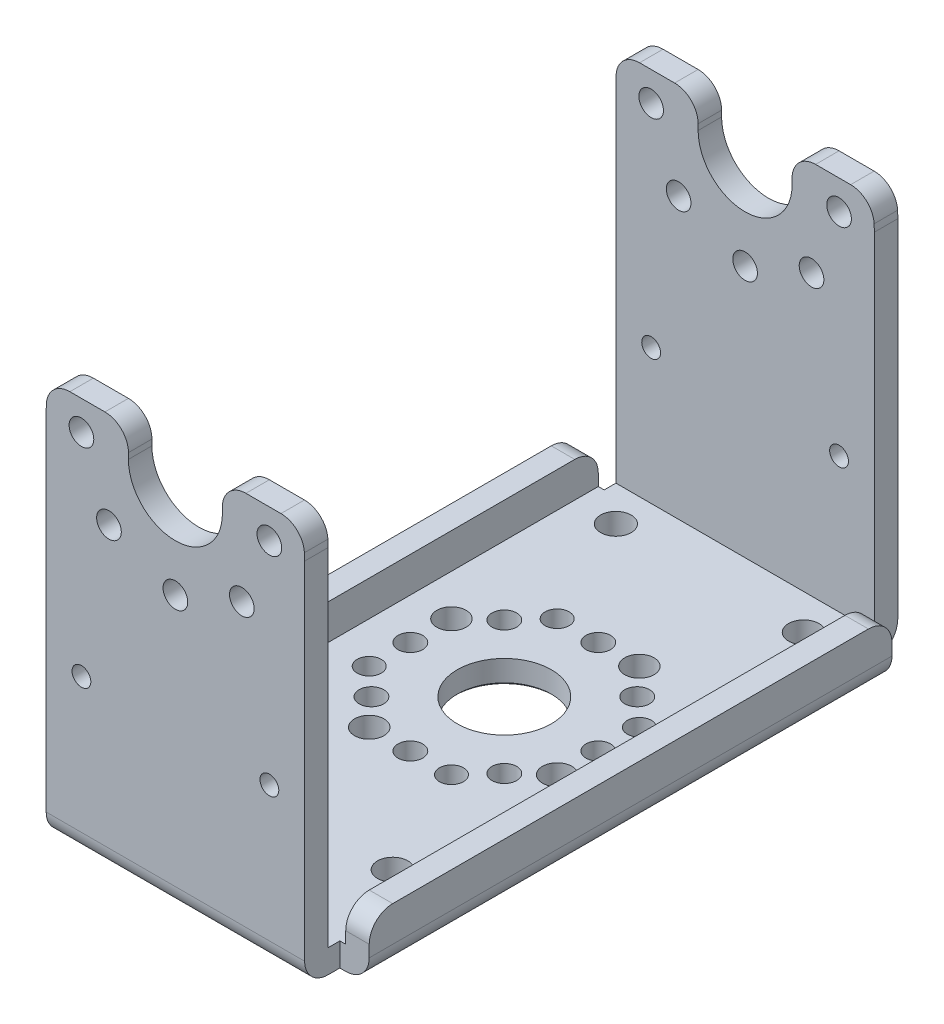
ISO-10303-21;
HEADER;
FILE_DESCRIPTION(('STEP AP214'),'2;1');
FILE_NAME('part.step','',(''),(''),'','','');
FILE_SCHEMA(('AUTOMOTIVE_DESIGN { 1 0 10303 214 1 1 1 1 }'));
ENDSEC;
DATA;
#1=APPLICATION_CONTEXT('core data for automotive mechanical design processes');
#2=APPLICATION_PROTOCOL_DEFINITION('international standard','automotive_design',2000,#1);
#3=PRODUCT_CONTEXT('',#1,'mechanical');
#4=PRODUCT('Part','Part','',(#3));
#5=PRODUCT_RELATED_PRODUCT_CATEGORY('part','',(#4));
#6=PRODUCT_DEFINITION_FORMATION('','',#4);
#7=PRODUCT_DEFINITION_CONTEXT('part definition',#1,'design');
#8=PRODUCT_DEFINITION('design','',#6,#7);
#9=PRODUCT_DEFINITION_SHAPE('','',#8);
#10=(LENGTH_UNIT() NAMED_UNIT(*) SI_UNIT(.MILLI.,.METRE.));
#11=(NAMED_UNIT(*) PLANE_ANGLE_UNIT() SI_UNIT($,.RADIAN.));
#12=(NAMED_UNIT(*) SI_UNIT($,.STERADIAN.) SOLID_ANGLE_UNIT());
#13=UNCERTAINTY_MEASURE_WITH_UNIT(LENGTH_MEASURE(1.E-05),#10,'distance_accuracy_value','');
#14=(GEOMETRIC_REPRESENTATION_CONTEXT(3) GLOBAL_UNCERTAINTY_ASSIGNED_CONTEXT((#13)) GLOBAL_UNIT_ASSIGNED_CONTEXT((#10,
#11,#12)) REPRESENTATION_CONTEXT('',''));
#15=CARTESIAN_POINT('',(0.,0.,0.));
#16=DIRECTION('',(0.,0.,1.));
#17=DIRECTION('',(1.,0.,0.));
#18=AXIS2_PLACEMENT_3D('',#15,#16,#17);
#19=CARTESIAN_POINT('',(25.5000000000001,-267.5,25.));
#20=DIRECTION('',(0.,0.,-1.));
#21=DIRECTION('',(-1.,0.,0.));
#22=AXIS2_PLACEMENT_3D('',#19,#20,#21);
#23=CYLINDRICAL_SURFACE('',#22,2.00000000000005);
#24=CARTESIAN_POINT('',(25.5000000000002,-267.5,-19.5));
#25=DIRECTION('',(0.,0.,-1.));
#26=DIRECTION('',(-1.,0.,0.));
#27=AXIS2_PLACEMENT_3D('',#24,#25,#26);
#28=CIRCLE('',#27,2.00000000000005);
#29=CARTESIAN_POINT('',(25.5000000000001,-269.5,-19.5));
#30=VERTEX_POINT('',#29);
#31=CARTESIAN_POINT('',(23.5,-267.5,-19.5));
#32=VERTEX_POINT('',#31);
#33=EDGE_CURVE('E362',#30,#32,#28,.T.);
#34=ORIENTED_EDGE('',*,*,#33,.F.);
#35=DIRECTION('',(0.,0.,-1.));
#36=VECTOR('',#35,1.);
#37=CARTESIAN_POINT('',(25.5,-269.5,-20.5));
#38=LINE('',#37,#36);
#39=CARTESIAN_POINT('',(25.5,-269.5,25.));
#40=VERTEX_POINT('',#39);
#41=EDGE_CURVE('E325',#40,#30,#38,.T.);
#42=ORIENTED_EDGE('',*,*,#41,.F.);
#43=CARTESIAN_POINT('',(25.5000000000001,-267.5,25.));
#44=DIRECTION('',(0.,0.,-1.));
#45=DIRECTION('',(-1.,0.,0.));
#46=AXIS2_PLACEMENT_3D('',#43,#44,#45);
#47=CIRCLE('',#46,2.00000000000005);
#48=CARTESIAN_POINT('',(23.5,-267.5,25.));
#49=VERTEX_POINT('',#48);
#50=EDGE_CURVE('E21',#49,#40,#47,.F.);
#51=ORIENTED_EDGE('',*,*,#50,.F.);
#52=DIRECTION('',(0.,0.,1.));
#53=VECTOR('',#52,1.);
#54=CARTESIAN_POINT('',(23.5,-267.5,25.));
#55=LINE('',#54,#53);
#56=EDGE_CURVE('E322',#32,#49,#55,.T.);
#57=ORIENTED_EDGE('',*,*,#56,.F.);
#58=EDGE_LOOP('',(#34,#42,#51,#57));
#59=FACE_BOUND('',#58,.T.);
#60=ADVANCED_FACE('F17',(#59),#23,.T.);
#61=CARTESIAN_POINT('',(48.4999999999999,-267.5,-19.5));
#62=DIRECTION('',(0.,0.,1.));
#63=DIRECTION('',(1.,0.,0.));
#64=AXIS2_PLACEMENT_3D('',#61,#62,#63);
#65=CYLINDRICAL_SURFACE('',#64,2.00000000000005);
#66=CARTESIAN_POINT('',(48.4999999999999,-267.5,25.));
#67=DIRECTION('',(0.,0.,1.));
#68=DIRECTION('',(1.,0.,0.));
#69=AXIS2_PLACEMENT_3D('',#66,#67,#68);
#70=CIRCLE('',#69,2.00000000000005);
#71=CARTESIAN_POINT('',(48.5,-269.5,25.));
#72=VERTEX_POINT('',#71);
#73=CARTESIAN_POINT('',(50.5,-267.5,25.));
#74=VERTEX_POINT('',#73);
#75=EDGE_CURVE('E694',#72,#74,#70,.T.);
#76=ORIENTED_EDGE('',*,*,#75,.F.);
#77=DIRECTION('',(0.,0.,-1.));
#78=VECTOR('',#77,1.);
#79=CARTESIAN_POINT('',(48.5,-269.5,-20.5));
#80=LINE('',#79,#78);
#81=CARTESIAN_POINT('',(48.5,-269.5,-19.5));
#82=VERTEX_POINT('',#81);
#83=EDGE_CURVE('E661',#82,#72,#80,.F.);
#84=ORIENTED_EDGE('',*,*,#83,.F.);
#85=CARTESIAN_POINT('',(48.4999999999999,-267.5,-19.5));
#86=DIRECTION('',(0.,0.,1.));
#87=DIRECTION('',(1.,0.,0.));
#88=AXIS2_PLACEMENT_3D('',#85,#86,#87);
#89=CIRCLE('',#88,2.00000000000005);
#90=CARTESIAN_POINT('',(50.5,-267.5,-19.5));
#91=VERTEX_POINT('',#90);
#92=EDGE_CURVE('E671',#91,#82,#89,.F.);
#93=ORIENTED_EDGE('',*,*,#92,.F.);
#94=DIRECTION('',(0.,0.,-1.));
#95=VECTOR('',#94,1.);
#96=CARTESIAN_POINT('',(50.5,-267.5,-19.5));
#97=LINE('',#96,#95);
#98=EDGE_CURVE('E358',#74,#91,#97,.T.);
#99=ORIENTED_EDGE('',*,*,#98,.F.);
#100=EDGE_LOOP('',(#76,#84,#93,#99));
#101=FACE_BOUND('',#100,.T.);
#102=ADVANCED_FACE('F1254',(#101),#65,.T.);
#103=CARTESIAN_POINT('',(23.5,-267.5,25.));
#104=DIRECTION('',(-1.,0.,0.));
#105=DIRECTION('',(0.,0.,1.));
#106=AXIS2_PLACEMENT_3D('',#103,#104,#105);
#107=PLANE('',#106);
#108=CARTESIAN_POINT('',(23.5,-266.5,23.0000000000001));
#109=DIRECTION('',(1.,0.,0.));
#110=DIRECTION('',(0.,0.,-1.));
#111=AXIS2_PLACEMENT_3D('',#108,#109,#110);
#112=CIRCLE('',#111,1.99999999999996);
#113=CARTESIAN_POINT('',(23.5,-264.5,23.0000000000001));
#114=VERTEX_POINT('',#113);
#115=CARTESIAN_POINT('',(23.5,-266.5,25.));
#116=VERTEX_POINT('',#115);
#117=EDGE_CURVE('E633',#114,#116,#112,.T.);
#118=ORIENTED_EDGE('',*,*,#117,.F.);
#119=DIRECTION('',(0.,0.,1.));
#120=VECTOR('',#119,1.);
#121=CARTESIAN_POINT('',(23.5,-264.5,23.));
#122=LINE('',#121,#120);
#123=CARTESIAN_POINT('',(23.5,-264.5,-17.5000000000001));
#124=VERTEX_POINT('',#123);
#125=EDGE_CURVE('E640',#124,#114,#122,.T.);
#126=ORIENTED_EDGE('',*,*,#125,.F.);
#127=CARTESIAN_POINT('',(23.5,-266.5,-17.5000000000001));
#128=DIRECTION('',(1.,0.,0.));
#129=DIRECTION('',(0.,0.,-1.));
#130=AXIS2_PLACEMENT_3D('',#127,#128,#129);
#131=CIRCLE('',#130,1.99999999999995);
#132=CARTESIAN_POINT('',(23.5,-266.5,-19.5));
#133=VERTEX_POINT('',#132);
#134=EDGE_CURVE('E644',#133,#124,#131,.T.);
#135=ORIENTED_EDGE('',*,*,#134,.F.);
#136=DIRECTION('',(0.,1.,0.));
#137=VECTOR('',#136,1.);
#138=CARTESIAN_POINT('',(23.5000000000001,-269.512,-19.5));
#139=LINE('',#138,#137);
#140=EDGE_CURVE('E335',#32,#133,#139,.T.);
#141=ORIENTED_EDGE('',*,*,#140,.F.);
#142=ORIENTED_EDGE('',*,*,#56,.T.);
#143=DIRECTION('',(0.,1.,0.));
#144=VECTOR('',#143,1.);
#145=CARTESIAN_POINT('',(23.5,-269.512,25.));
#146=LINE('',#145,#144);
#147=EDGE_CURVE('E332',#116,#49,#146,.F.);
#148=ORIENTED_EDGE('',*,*,#147,.F.);
#149=EDGE_LOOP('',(#118,#126,#135,#141,#142,#148));
#150=FACE_BOUND('',#149,.T.);
#151=ADVANCED_FACE('F331',(#150),#107,.T.);
#152=CARTESIAN_POINT('',(26.,-267.5,25.9999999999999));
#153=DIRECTION('',(1.,0.,0.));
#154=DIRECTION('',(0.,0.,-1.));
#155=AXIS2_PLACEMENT_3D('',#152,#153,#154);
#156=CYLINDRICAL_SURFACE('',#155,2.00000000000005);
#157=CARTESIAN_POINT('',(48.,-267.5,26.));
#158=DIRECTION('',(1.,0.,0.));
#159=DIRECTION('',(0.,0.,-1.));
#160=AXIS2_PLACEMENT_3D('',#157,#158,#159);
#161=CIRCLE('',#160,2.00000000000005);
#162=CARTESIAN_POINT('',(48.,-267.5,28.));
#163=VERTEX_POINT('',#162);
#164=CARTESIAN_POINT('',(48.,-269.5,26.));
#165=VERTEX_POINT('',#164);
#166=EDGE_CURVE('E384',#163,#165,#161,.T.);
#167=ORIENTED_EDGE('',*,*,#166,.F.);
#168=DIRECTION('',(1.,0.,0.));
#169=VECTOR('',#168,1.);
#170=CARTESIAN_POINT('',(26.,-267.5,28.));
#171=LINE('',#170,#169);
#172=CARTESIAN_POINT('',(26.,-267.5,28.));
#173=VERTEX_POINT('',#172);
#174=EDGE_CURVE('E719',#173,#163,#171,.T.);
#175=ORIENTED_EDGE('',*,*,#174,.F.);
#176=CARTESIAN_POINT('',(26.,-267.5,25.9999999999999));
#177=DIRECTION('',(1.,0.,0.));
#178=DIRECTION('',(0.,0.,-1.));
#179=AXIS2_PLACEMENT_3D('',#176,#177,#178);
#180=CIRCLE('',#179,2.00000000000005);
#181=CARTESIAN_POINT('',(26.,-269.5,26.));
#182=VERTEX_POINT('',#181);
#183=EDGE_CURVE('E378',#182,#173,#180,.F.);
#184=ORIENTED_EDGE('',*,*,#183,.F.);
#185=DIRECTION('',(1.,0.,0.));
#186=VECTOR('',#185,1.);
#187=CARTESIAN_POINT('',(25.5,-269.5,26.));
#188=LINE('',#187,#186);
#189=EDGE_CURVE('E703',#165,#182,#188,.F.);
#190=ORIENTED_EDGE('',*,*,#189,.F.);
#191=EDGE_LOOP('',(#167,#175,#184,#190));
#192=FACE_BOUND('',#191,.T.);
#193=ADVANCED_FACE('F1040',(#192),#156,.T.);
#194=CARTESIAN_POINT('',(23.488,-269.512,25.));
#195=DIRECTION('',(0.,0.,1.));
#196=DIRECTION('',(1.,0.,0.));
#197=AXIS2_PLACEMENT_3D('',#194,#195,#196);
#198=PLANE('',#197);
#199=DIRECTION('',(1.,0.,0.));
#200=VECTOR('',#199,1.);
#201=CARTESIAN_POINT('',(23.3,-266.5,25.));
#202=LINE('',#201,#200);
#203=CARTESIAN_POINT('',(25.5,-266.5,25.));
#204=VERTEX_POINT('',#203);
#205=EDGE_CURVE('E340',#116,#204,#202,.T.);
#206=ORIENTED_EDGE('',*,*,#205,.F.);
#207=ORIENTED_EDGE('',*,*,#147,.T.);
#208=ORIENTED_EDGE('',*,*,#50,.T.);
#209=DIRECTION('',(1.,0.,0.));
#210=VECTOR('',#209,1.);
#211=CARTESIAN_POINT('',(25.5,-269.5,25.));
#212=LINE('',#211,#210);
#213=CARTESIAN_POINT('',(26.,-269.5,25.));
#214=VERTEX_POINT('',#213);
#215=EDGE_CURVE('E706',#214,#40,#212,.F.);
#216=ORIENTED_EDGE('',*,*,#215,.F.);
#217=DIRECTION('',(0.,1.,0.));
#218=VECTOR('',#217,1.);
#219=CARTESIAN_POINT('',(26.,-269.512,25.));
#220=LINE('',#219,#218);
#221=CARTESIAN_POINT('',(26.,-267.5,25.));
#222=VERTEX_POINT('',#221);
#223=EDGE_CURVE('E391',#222,#214,#220,.F.);
#224=ORIENTED_EDGE('',*,*,#223,.F.);
#225=DIRECTION('',(1.,0.,0.));
#226=VECTOR('',#225,1.);
#227=CARTESIAN_POINT('',(23.488,-267.5,25.));
#228=LINE('',#227,#226);
#229=CARTESIAN_POINT('',(25.5,-267.5,25.));
#230=VERTEX_POINT('',#229);
#231=EDGE_CURVE('E329',#222,#230,#228,.F.);
#232=ORIENTED_EDGE('',*,*,#231,.T.);
#233=DIRECTION('',(0.,1.,0.));
#234=VECTOR('',#233,1.);
#235=CARTESIAN_POINT('',(25.5,-269.512,25.));
#236=LINE('',#235,#234);
#237=EDGE_CURVE('E343',#230,#204,#236,.T.);
#238=ORIENTED_EDGE('',*,*,#237,.T.);
#239=EDGE_LOOP('',(#206,#207,#208,#216,#224,#232,#238));
#240=FACE_BOUND('',#239,.T.);
#241=ADVANCED_FACE('F338',(#240),#198,.T.);
#242=CARTESIAN_POINT('',(36.9999999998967,-238.,28.2));
#243=DIRECTION('',(0.,0.,-1.));
#244=DIRECTION('',(-1.,0.,0.));
#245=AXIS2_PLACEMENT_3D('',#242,#243,#244);
#246=CYLINDRICAL_SURFACE('',#245,10.9999999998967);
#247=DIRECTION('',(0.,0.,1.));
#248=VECTOR('',#247,1.);
#249=CARTESIAN_POINT('',(26.,-238.,28.012));
#250=LINE('',#249,#248);
#251=CARTESIAN_POINT('',(26.,-238.,28.));
#252=VERTEX_POINT('',#251);
#253=CARTESIAN_POINT('',(26.,-238.,26.));
#254=VERTEX_POINT('',#253);
#255=EDGE_CURVE('E397',#252,#254,#250,.F.);
#256=ORIENTED_EDGE('',*,*,#255,.F.);
#257=CARTESIAN_POINT('',(36.9999999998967,-238.,28.));
#258=DIRECTION('',(0.,0.,-1.));
#259=DIRECTION('',(-1.,0.,0.));
#260=AXIS2_PLACEMENT_3D('',#257,#258,#259);
#261=CIRCLE('',#260,10.9999999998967);
#262=CARTESIAN_POINT('',(26.0169884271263,-237.388888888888,28.));
#263=VERTEX_POINT('',#262);
#264=EDGE_CURVE('E350',#263,#252,#261,.F.);
#265=ORIENTED_EDGE('',*,*,#264,.F.);
#266=DIRECTION('',(0.,0.,-1.));
#267=VECTOR('',#266,1.);
#268=CARTESIAN_POINT('',(26.016988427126,-237.388888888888,28.2));
#269=LINE('',#268,#267);
#270=CARTESIAN_POINT('',(26.0169884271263,-237.388888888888,26.));
#271=VERTEX_POINT('',#270);
#272=EDGE_CURVE('E609',#271,#263,#269,.F.);
#273=ORIENTED_EDGE('',*,*,#272,.F.);
#274=CARTESIAN_POINT('',(36.9999999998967,-238.,26.));
#275=DIRECTION('',(0.,0.,-1.));
#276=DIRECTION('',(-1.,0.,0.));
#277=AXIS2_PLACEMENT_3D('',#274,#275,#276);
#278=CIRCLE('',#277,10.9999999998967);
#279=EDGE_CURVE('E342',#271,#254,#278,.F.);
#280=ORIENTED_EDGE('',*,*,#279,.T.);
#281=EDGE_LOOP('',(#256,#265,#273,#280));
#282=FACE_BOUND('',#281,.T.);
#283=ADVANCED_FACE('F1034',(#282),#246,.T.);
#284=CARTESIAN_POINT('',(33.,-238.,26.));
#285=DIRECTION('',(1.,0.,0.));
#286=DIRECTION('',(0.,0.,-1.));
#287=AXIS2_PLACEMENT_3D('',#284,#285,#286);
#288=PLANE('',#287);
#289=DIRECTION('',(0.,1.,0.));
#290=VECTOR('',#289,1.);
#291=CARTESIAN_POINT('',(33.,-267.5,28.));
#292=LINE('',#291,#290);
#293=CARTESIAN_POINT('',(33.0000000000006,-238.,28.));
#294=VERTEX_POINT('',#293);
#295=CARTESIAN_POINT('',(33.,-237.5,28.));
#296=VERTEX_POINT('',#295);
#297=EDGE_CURVE('E348',#294,#296,#292,.T.);
#298=ORIENTED_EDGE('',*,*,#297,.F.);
#299=DIRECTION('',(0.,0.,-1.));
#300=VECTOR('',#299,1.);
#301=CARTESIAN_POINT('',(33.0000000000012,-238.,28.2));
#302=LINE('',#301,#300);
#303=CARTESIAN_POINT('',(33.0000000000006,-238.,26.));
#304=VERTEX_POINT('',#303);
#305=EDGE_CURVE('E592',#294,#304,#302,.T.);
#306=ORIENTED_EDGE('',*,*,#305,.T.);
#307=DIRECTION('',(0.,1.,0.));
#308=VECTOR('',#307,1.);
#309=CARTESIAN_POINT('',(33.,-238.,26.));
#310=LINE('',#309,#308);
#311=CARTESIAN_POINT('',(33.,-237.5,26.));
#312=VERTEX_POINT('',#311);
#313=EDGE_CURVE('E345',#304,#312,#310,.T.);
#314=ORIENTED_EDGE('',*,*,#313,.T.);
#315=DIRECTION('',(0.,0.,-1.));
#316=VECTOR('',#315,1.);
#317=CARTESIAN_POINT('',(33.,-237.5,28.2));
#318=LINE('',#317,#316);
#319=EDGE_CURVE('E599',#296,#312,#318,.T.);
#320=ORIENTED_EDGE('',*,*,#319,.F.);
#321=EDGE_LOOP('',(#298,#306,#314,#320));
#322=FACE_BOUND('',#321,.T.);
#323=ADVANCED_FACE('F1073',(#322),#288,.T.);
#324=CARTESIAN_POINT('',(41.,-238.,26.));
#325=DIRECTION('',(-1.,0.,0.));
#326=DIRECTION('',(0.,0.,1.));
#327=AXIS2_PLACEMENT_3D('',#324,#325,#326);
#328=PLANE('',#327);
#329=DIRECTION('',(0.,0.,-1.));
#330=VECTOR('',#329,1.);
#331=CARTESIAN_POINT('',(41.,-237.5,28.2));
#332=LINE('',#331,#330);
#333=CARTESIAN_POINT('',(41.,-237.5,26.));
#334=VERTEX_POINT('',#333);
#335=CARTESIAN_POINT('',(41.,-237.5,28.));
#336=VERTEX_POINT('',#335);
#337=EDGE_CURVE('E588',#334,#336,#332,.F.);
#338=ORIENTED_EDGE('',*,*,#337,.F.);
#339=DIRECTION('',(0.,1.,0.));
#340=VECTOR('',#339,1.);
#341=CARTESIAN_POINT('',(41.,-238.,26.));
#342=LINE('',#341,#340);
#343=CARTESIAN_POINT('',(41.0000000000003,-237.999999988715,26.));
#344=VERTEX_POINT('',#343);
#345=EDGE_CURVE('E354',#334,#344,#342,.F.);
#346=ORIENTED_EDGE('',*,*,#345,.T.);
#347=DIRECTION('',(0.,0.,-1.));
#348=VECTOR('',#347,1.);
#349=CARTESIAN_POINT('',(41.0000000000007,-237.999999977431,28.2));
#350=LINE('',#349,#348);
#351=CARTESIAN_POINT('',(41.0000000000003,-237.999999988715,28.));
#352=VERTEX_POINT('',#351);
#353=EDGE_CURVE('E595',#344,#352,#350,.F.);
#354=ORIENTED_EDGE('',*,*,#353,.T.);
#355=DIRECTION('',(0.,1.,0.));
#356=VECTOR('',#355,1.);
#357=CARTESIAN_POINT('',(41.,-267.5,28.));
#358=LINE('',#357,#356);
#359=EDGE_CURVE('E351',#336,#352,#358,.F.);
#360=ORIENTED_EDGE('',*,*,#359,.F.);
#361=EDGE_LOOP('',(#338,#346,#354,#360));
#362=FACE_BOUND('',#361,.T.);
#363=ADVANCED_FACE('F1775',(#362),#328,.T.);
#364=CARTESIAN_POINT('',(26.,-267.5,28.));
#365=DIRECTION('',(0.,0.,1.));
#366=DIRECTION('',(1.,0.,0.));
#367=AXIS2_PLACEMENT_3D('',#364,#365,#366);
#368=PLANE('',#367);
#369=CARTESIAN_POINT('',(29.,-238.,28.));
#370=DIRECTION('',(0.,0.,1.));
#371=DIRECTION('',(1.,0.,0.));
#372=AXIS2_PLACEMENT_3D('',#369,#370,#371);
#373=CIRCLE('',#372,1.05);
#374=CARTESIAN_POINT('',(30.05,-238.,28.));
#375=VERTEX_POINT('',#374);
#376=EDGE_CURVE('E636',#375,#375,#373,.F.);
#377=ORIENTED_EDGE('',*,*,#376,.T.);
#378=EDGE_LOOP('',(#377));
#379=FACE_BOUND('',#378,.T.);
#380=CARTESIAN_POINT('',(31.343145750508,-243.656854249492,28.));
#381=DIRECTION('',(0.,0.,1.));
#382=DIRECTION('',(1.,0.,0.));
#383=AXIS2_PLACEMENT_3D('',#380,#381,#382);
#384=CIRCLE('',#383,1.05);
#385=CARTESIAN_POINT('',(32.393145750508,-243.656854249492,28.));
#386=VERTEX_POINT('',#385);
#387=EDGE_CURVE('E988',#386,#386,#384,.F.);
#388=ORIENTED_EDGE('',*,*,#387,.T.);
#389=EDGE_LOOP('',(#388));
#390=FACE_BOUND('',#389,.T.);
#391=CARTESIAN_POINT('',(37.,-246.,28.));
#392=DIRECTION('',(0.,0.,1.));
#393=DIRECTION('',(1.,0.,0.));
#394=AXIS2_PLACEMENT_3D('',#391,#392,#393);
#395=CIRCLE('',#394,1.05);
#396=CARTESIAN_POINT('',(38.05,-246.,28.));
#397=VERTEX_POINT('',#396);
#398=EDGE_CURVE('E985',#397,#397,#395,.F.);
#399=ORIENTED_EDGE('',*,*,#398,.T.);
#400=EDGE_LOOP('',(#399));
#401=FACE_BOUND('',#400,.T.);
#402=CARTESIAN_POINT('',(42.656854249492,-243.656854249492,28.));
#403=DIRECTION('',(0.,0.,1.));
#404=DIRECTION('',(1.,0.,0.));
#405=AXIS2_PLACEMENT_3D('',#402,#403,#404);
#406=CIRCLE('',#405,1.05);
#407=CARTESIAN_POINT('',(43.706854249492,-243.656854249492,28.));
#408=VERTEX_POINT('',#407);
#409=EDGE_CURVE('E982',#408,#408,#406,.F.);
#410=ORIENTED_EDGE('',*,*,#409,.T.);
#411=EDGE_LOOP('',(#410));
#412=FACE_BOUND('',#411,.T.);
#413=CARTESIAN_POINT('',(45.,-238.,28.));
#414=DIRECTION('',(0.,0.,1.));
#415=DIRECTION('',(1.,0.,0.));
#416=AXIS2_PLACEMENT_3D('',#413,#414,#415);
#417=CIRCLE('',#416,1.05);
#418=CARTESIAN_POINT('',(46.05,-238.,28.));
#419=VERTEX_POINT('',#418);
#420=EDGE_CURVE('E979',#419,#419,#417,.F.);
#421=ORIENTED_EDGE('',*,*,#420,.T.);
#422=EDGE_LOOP('',(#421));
#423=FACE_BOUND('',#422,.T.);
#424=CARTESIAN_POINT('',(29.,-256.,28.));
#425=DIRECTION('',(0.,0.,-1.));
#426=DIRECTION('',(-1.,0.,0.));
#427=AXIS2_PLACEMENT_3D('',#424,#425,#426);
#428=CIRCLE('',#427,0.800000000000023);
#429=CARTESIAN_POINT('',(28.2,-256.,28.));
#430=VERTEX_POINT('',#429);
#431=EDGE_CURVE('E976',#430,#430,#428,.T.);
#432=ORIENTED_EDGE('',*,*,#431,.T.);
#433=EDGE_LOOP('',(#432));
#434=FACE_BOUND('',#433,.T.);
#435=CARTESIAN_POINT('',(45.,-256.,28.));
#436=DIRECTION('',(0.,0.,-1.));
#437=DIRECTION('',(-1.,0.,0.));
#438=AXIS2_PLACEMENT_3D('',#435,#436,#437);
#439=CIRCLE('',#438,0.800000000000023);
#440=CARTESIAN_POINT('',(44.2,-256.,28.));
#441=VERTEX_POINT('',#440);
#442=EDGE_CURVE('E973',#441,#441,#439,.T.);
#443=ORIENTED_EDGE('',*,*,#442,.T.);
#444=EDGE_LOOP('',(#443));
#445=FACE_BOUND('',#444,.T.);
#446=DIRECTION('',(0.,1.,0.));
#447=VECTOR('',#446,1.);
#448=CARTESIAN_POINT('',(48.,-269.512,28.));
#449=LINE('',#448,#447);
#450=CARTESIAN_POINT('',(48.,-238.,28.));
#451=VERTEX_POINT('',#450);
#452=EDGE_CURVE('E375',#451,#163,#449,.F.);
#453=ORIENTED_EDGE('',*,*,#452,.F.);
#454=CARTESIAN_POINT('',(37.0000000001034,-238.,28.));
#455=DIRECTION('',(0.,0.,-1.));
#456=DIRECTION('',(-1.,0.,0.));
#457=AXIS2_PLACEMENT_3D('',#454,#455,#456);
#458=CIRCLE('',#457,10.9999999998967);
#459=CARTESIAN_POINT('',(47.9830115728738,-237.388888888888,28.));
#460=VERTEX_POINT('',#459);
#461=EDGE_CURVE('E1022',#460,#451,#458,.T.);
#462=ORIENTED_EDGE('',*,*,#461,.F.);
#463=CARTESIAN_POINT('',(45.986100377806,-237.5,28.));
#464=DIRECTION('',(0.,0.,-1.));
#465=DIRECTION('',(-1.,0.,0.));
#466=AXIS2_PLACEMENT_3D('',#463,#464,#465);
#467=CIRCLE('',#466,2.00000000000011);
#468=CARTESIAN_POINT('',(45.986100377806,-235.5,28.));
#469=VERTEX_POINT('',#468);
#470=EDGE_CURVE('E581',#469,#460,#467,.T.);
#471=ORIENTED_EDGE('',*,*,#470,.F.);
#472=DIRECTION('',(1.,0.,0.));
#473=VECTOR('',#472,1.);
#474=CARTESIAN_POINT('',(45.986100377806,-235.5,28.));
#475=LINE('',#474,#473);
#476=CARTESIAN_POINT('',(43.,-235.5,28.));
#477=VERTEX_POINT('',#476);
#478=EDGE_CURVE('E587',#477,#469,#475,.T.);
#479=ORIENTED_EDGE('',*,*,#478,.F.);
#480=CARTESIAN_POINT('',(43.,-237.5,28.));
#481=DIRECTION('',(0.,0.,-1.));
#482=DIRECTION('',(-1.,0.,0.));
#483=AXIS2_PLACEMENT_3D('',#480,#481,#482);
#484=CIRCLE('',#483,1.99999999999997);
#485=EDGE_CURVE('E591',#336,#477,#484,.T.);
#486=ORIENTED_EDGE('',*,*,#485,.F.);
#487=ORIENTED_EDGE('',*,*,#359,.T.);
#488=CARTESIAN_POINT('',(37.0000000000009,-238.,28.));
#489=DIRECTION('',(0.,0.,-1.));
#490=DIRECTION('',(-1.,0.,0.));
#491=AXIS2_PLACEMENT_3D('',#488,#489,#490);
#492=CIRCLE('',#491,3.99999999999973);
#493=EDGE_CURVE('E598',#352,#294,#492,.T.);
#494=ORIENTED_EDGE('',*,*,#493,.T.);
#495=ORIENTED_EDGE('',*,*,#297,.T.);
#496=CARTESIAN_POINT('',(31.0000000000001,-237.5,28.));
#497=DIRECTION('',(0.,0.,-1.));
#498=DIRECTION('',(-1.,0.,0.));
#499=AXIS2_PLACEMENT_3D('',#496,#497,#498);
#500=CIRCLE('',#499,1.99999999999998);
#501=CARTESIAN_POINT('',(31.,-235.5,28.));
#502=VERTEX_POINT('',#501);
#503=EDGE_CURVE('E602',#502,#296,#500,.T.);
#504=ORIENTED_EDGE('',*,*,#503,.F.);
#505=DIRECTION('',(1.,0.,0.));
#506=VECTOR('',#505,1.);
#507=CARTESIAN_POINT('',(31.,-235.5,28.));
#508=LINE('',#507,#506);
#509=CARTESIAN_POINT('',(28.013899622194,-235.5,28.));
#510=VERTEX_POINT('',#509);
#511=EDGE_CURVE('E608',#510,#502,#508,.T.);
#512=ORIENTED_EDGE('',*,*,#511,.F.);
#513=CARTESIAN_POINT('',(28.013899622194,-237.5,28.));
#514=DIRECTION('',(0.,0.,-1.));
#515=DIRECTION('',(-1.,0.,0.));
#516=AXIS2_PLACEMENT_3D('',#513,#514,#515);
#517=CIRCLE('',#516,2.0000000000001);
#518=EDGE_CURVE('E390',#263,#510,#517,.T.);
#519=ORIENTED_EDGE('',*,*,#518,.F.);
#520=ORIENTED_EDGE('',*,*,#264,.T.);
#521=DIRECTION('',(0.,1.,0.));
#522=VECTOR('',#521,1.);
#523=CARTESIAN_POINT('',(26.,-269.512,28.));
#524=LINE('',#523,#522);
#525=EDGE_CURVE('E394',#173,#252,#524,.T.);
#526=ORIENTED_EDGE('',*,*,#525,.F.);
#527=ORIENTED_EDGE('',*,*,#174,.T.);
#528=EDGE_LOOP('',(#453,#462,#471,#479,#486,#487,#494,#495,#504,#512,#519,#520,#526,#527));
#529=FACE_BOUND('',#528,.T.);
#530=ADVANCED_FACE('F1030',(#379,#390,#401,#412,#423,#434,#445,#529),#368,.T.);
#531=CARTESIAN_POINT('',(37.0000000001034,-238.,28.2));
#532=DIRECTION('',(0.,0.,-1.));
#533=DIRECTION('',(-1.,0.,0.));
#534=AXIS2_PLACEMENT_3D('',#531,#532,#533);
#535=CYLINDRICAL_SURFACE('',#534,10.9999999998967);
#536=ORIENTED_EDGE('',*,*,#461,.T.);
#537=DIRECTION('',(0.,0.,-1.));
#538=VECTOR('',#537,1.);
#539=CARTESIAN_POINT('',(48.,-238.,26.));
#540=LINE('',#539,#538);
#541=CARTESIAN_POINT('',(48.,-238.,26.));
#542=VERTEX_POINT('',#541);
#543=EDGE_CURVE('E379',#542,#451,#540,.F.);
#544=ORIENTED_EDGE('',*,*,#543,.F.);
#545=CARTESIAN_POINT('',(37.0000000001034,-238.,26.));
#546=DIRECTION('',(0.,0.,-1.));
#547=DIRECTION('',(-1.,0.,0.));
#548=AXIS2_PLACEMENT_3D('',#545,#546,#547);
#549=CIRCLE('',#548,10.9999999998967);
#550=CARTESIAN_POINT('',(47.9830115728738,-237.388888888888,26.));
#551=VERTEX_POINT('',#550);
#552=EDGE_CURVE('E722',#542,#551,#549,.F.);
#553=ORIENTED_EDGE('',*,*,#552,.T.);
#554=DIRECTION('',(0.,0.,-1.));
#555=VECTOR('',#554,1.);
#556=CARTESIAN_POINT('',(47.983011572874,-237.388888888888,28.2));
#557=LINE('',#556,#555);
#558=EDGE_CURVE('E577',#460,#551,#557,.T.);
#559=ORIENTED_EDGE('',*,*,#558,.F.);
#560=EDGE_LOOP('',(#536,#544,#553,#559));
#561=FACE_BOUND('',#560,.T.);
#562=ADVANCED_FACE('F1052',(#561),#535,.T.);
#563=CARTESIAN_POINT('',(48.5,-269.512,25.));
#564=DIRECTION('',(0.,0.,1.));
#565=DIRECTION('',(1.,0.,0.));
#566=AXIS2_PLACEMENT_3D('',#563,#564,#565);
#567=PLANE('',#566);
#568=DIRECTION('',(0.,1.,0.));
#569=VECTOR('',#568,1.);
#570=CARTESIAN_POINT('',(48.,-269.512,25.));
#571=LINE('',#570,#569);
#572=CARTESIAN_POINT('',(48.,-269.5,25.));
#573=VERTEX_POINT('',#572);
#574=CARTESIAN_POINT('',(48.,-267.5,25.));
#575=VERTEX_POINT('',#574);
#576=EDGE_CURVE('E383',#573,#575,#571,.T.);
#577=ORIENTED_EDGE('',*,*,#576,.F.);
#578=DIRECTION('',(1.,0.,0.));
#579=VECTOR('',#578,1.);
#580=CARTESIAN_POINT('',(25.5,-269.5,25.));
#581=LINE('',#580,#579);
#582=EDGE_CURVE('E707',#72,#573,#581,.F.);
#583=ORIENTED_EDGE('',*,*,#582,.F.);
#584=ORIENTED_EDGE('',*,*,#75,.T.);
#585=DIRECTION('',(0.,1.,0.));
#586=VECTOR('',#585,1.);
#587=CARTESIAN_POINT('',(50.5,-267.5,25.));
#588=LINE('',#587,#586);
#589=CARTESIAN_POINT('',(50.5,-266.5,25.));
#590=VERTEX_POINT('',#589);
#591=EDGE_CURVE('E355',#590,#74,#588,.F.);
#592=ORIENTED_EDGE('',*,*,#591,.F.);
#593=DIRECTION('',(-1.,0.,0.));
#594=VECTOR('',#593,1.);
#595=CARTESIAN_POINT('',(50.7,-266.5,25.));
#596=LINE('',#595,#594);
#597=CARTESIAN_POINT('',(48.5,-266.5,25.));
#598=VERTEX_POINT('',#597);
#599=EDGE_CURVE('E573',#598,#590,#596,.F.);
#600=ORIENTED_EDGE('',*,*,#599,.F.);
#601=DIRECTION('',(0.,1.,0.));
#602=VECTOR('',#601,1.);
#603=CARTESIAN_POINT('',(48.5,-269.512,25.));
#604=LINE('',#603,#602);
#605=CARTESIAN_POINT('',(48.5,-267.5,25.));
#606=VERTEX_POINT('',#605);
#607=EDGE_CURVE('E691',#598,#606,#604,.F.);
#608=ORIENTED_EDGE('',*,*,#607,.T.);
#609=DIRECTION('',(1.,0.,0.));
#610=VECTOR('',#609,1.);
#611=CARTESIAN_POINT('',(48.5,-267.5,25.));
#612=LINE('',#611,#610);
#613=EDGE_CURVE('E359',#606,#575,#612,.F.);
#614=ORIENTED_EDGE('',*,*,#613,.T.);
#615=EDGE_LOOP('',(#577,#583,#584,#592,#600,#608,#614));
#616=FACE_BOUND('',#615,.T.);
#617=ADVANCED_FACE('F1245',(#616),#567,.T.);
#618=CARTESIAN_POINT('',(50.5,-267.5,-19.5));
#619=DIRECTION('',(1.,0.,0.));
#620=DIRECTION('',(0.,0.,-1.));
#621=AXIS2_PLACEMENT_3D('',#618,#619,#620);
#622=PLANE('',#621);
#623=CARTESIAN_POINT('',(50.5,-266.5,-17.5000000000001));
#624=DIRECTION('',(-1.,0.,0.));
#625=DIRECTION('',(0.,0.,1.));
#626=AXIS2_PLACEMENT_3D('',#623,#624,#625);
#627=CIRCLE('',#626,1.99999999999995);
#628=CARTESIAN_POINT('',(50.5,-264.5,-17.5000000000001));
#629=VERTEX_POINT('',#628);
#630=CARTESIAN_POINT('',(50.5,-266.5,-19.5));
#631=VERTEX_POINT('',#630);
#632=EDGE_CURVE('E565',#629,#631,#627,.T.);
#633=ORIENTED_EDGE('',*,*,#632,.F.);
#634=DIRECTION('',(0.,0.,1.));
#635=VECTOR('',#634,1.);
#636=CARTESIAN_POINT('',(50.5,-264.5,-17.5));
#637=LINE('',#636,#635);
#638=CARTESIAN_POINT('',(50.5,-264.5,23.0000000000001));
#639=VERTEX_POINT('',#638);
#640=EDGE_CURVE('E572',#639,#629,#637,.F.);
#641=ORIENTED_EDGE('',*,*,#640,.F.);
#642=CARTESIAN_POINT('',(50.5,-266.5,23.0000000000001));
#643=DIRECTION('',(-1.,0.,0.));
#644=DIRECTION('',(0.,0.,1.));
#645=AXIS2_PLACEMENT_3D('',#642,#643,#644);
#646=CIRCLE('',#645,1.99999999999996);
#647=EDGE_CURVE('E576',#590,#639,#646,.T.);
#648=ORIENTED_EDGE('',*,*,#647,.F.);
#649=ORIENTED_EDGE('',*,*,#591,.T.);
#650=ORIENTED_EDGE('',*,*,#98,.T.);
#651=DIRECTION('',(0.,1.,0.));
#652=VECTOR('',#651,1.);
#653=CARTESIAN_POINT('',(50.5,-269.512,-19.5));
#654=LINE('',#653,#652);
#655=EDGE_CURVE('E363',#631,#91,#654,.F.);
#656=ORIENTED_EDGE('',*,*,#655,.F.);
#657=EDGE_LOOP('',(#633,#641,#648,#649,#650,#656));
#658=FACE_BOUND('',#657,.T.);
#659=ADVANCED_FACE('F1251',(#658),#622,.T.);
#660=CARTESIAN_POINT('',(29.,-256.,-22.4999999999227));
#661=DIRECTION('',(0.,0.,-1.));
#662=DIRECTION('',(-1.,0.,0.));
#663=AXIS2_PLACEMENT_3D('',#660,#661,#662);
#664=CONICAL_SURFACE('',#663,1.0999999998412,0.785398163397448);
#665=CARTESIAN_POINT('',(29.,-256.,-22.5000000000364));
#666=DIRECTION('',(0.,0.,-1.));
#667=DIRECTION('',(-1.,0.,0.));
#668=AXIS2_PLACEMENT_3D('',#665,#666,#667);
#669=CIRCLE('',#668,1.09999999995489);
#670=CARTESIAN_POINT('',(27.9000000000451,-256.,-22.5000000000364));
#671=VERTEX_POINT('',#670);
#672=EDGE_CURVE('E1012',#671,#671,#669,.F.);
#673=ORIENTED_EDGE('',*,*,#672,.F.);
#674=EDGE_LOOP('',(#673));
#675=FACE_BOUND('',#674,.T.);
#676=CARTESIAN_POINT('',(29.,-256.,-22.2));
#677=DIRECTION('',(0.,0.,-1.));
#678=DIRECTION('',(-1.,0.,0.));
#679=AXIS2_PLACEMENT_3D('',#676,#677,#678);
#680=CIRCLE('',#679,0.800000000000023);
#681=CARTESIAN_POINT('',(28.2,-256.,-22.2));
#682=VERTEX_POINT('',#681);
#683=EDGE_CURVE('E398',#682,#682,#680,.F.);
#684=ORIENTED_EDGE('',*,*,#683,.T.);
#685=EDGE_LOOP('',(#684));
#686=FACE_BOUND('',#685,.T.);
#687=ADVANCED_FACE('F1742',(#675,#686),#664,.F.);
#688=CARTESIAN_POINT('',(45.,-256.,-22.4999999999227));
#689=DIRECTION('',(0.,0.,-1.));
#690=DIRECTION('',(-1.,0.,0.));
#691=AXIS2_PLACEMENT_3D('',#688,#689,#690);
#692=CONICAL_SURFACE('',#691,1.09999999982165,0.785398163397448);
#693=CARTESIAN_POINT('',(45.,-256.,-22.5000000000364));
#694=DIRECTION('',(0.,0.,-1.));
#695=DIRECTION('',(-1.,0.,0.));
#696=AXIS2_PLACEMENT_3D('',#693,#694,#695);
#697=CIRCLE('',#696,1.09999999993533);
#698=CARTESIAN_POINT('',(43.9000000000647,-256.,-22.5000000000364));
#699=VERTEX_POINT('',#698);
#700=EDGE_CURVE('E370',#699,#699,#697,.F.);
#701=ORIENTED_EDGE('',*,*,#700,.F.);
#702=EDGE_LOOP('',(#701));
#703=FACE_BOUND('',#702,.T.);
#704=CARTESIAN_POINT('',(45.,-256.,-22.2));
#705=DIRECTION('',(0.,0.,-1.));
#706=DIRECTION('',(-1.,0.,0.));
#707=AXIS2_PLACEMENT_3D('',#704,#705,#706);
#708=CIRCLE('',#707,0.800000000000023);
#709=CARTESIAN_POINT('',(44.2,-256.,-22.2));
#710=VERTEX_POINT('',#709);
#711=EDGE_CURVE('E401',#710,#710,#708,.F.);
#712=ORIENTED_EDGE('',*,*,#711,.T.);
#713=EDGE_LOOP('',(#712));
#714=FACE_BOUND('',#713,.T.);
#715=ADVANCED_FACE('F1735',(#703,#714),#692,.F.);
#716=CARTESIAN_POINT('',(25.5,-269.512,-19.5));
#717=DIRECTION('',(0.,0.,-1.));
#718=DIRECTION('',(-1.,0.,0.));
#719=AXIS2_PLACEMENT_3D('',#716,#717,#718);
#720=PLANE('',#719);
#721=DIRECTION('',(0.,1.,0.));
#722=VECTOR('',#721,1.);
#723=CARTESIAN_POINT('',(26.,-269.512,-19.5));
#724=LINE('',#723,#722);
#725=CARTESIAN_POINT('',(26.,-269.5,-19.5));
#726=VERTEX_POINT('',#725);
#727=CARTESIAN_POINT('',(26.,-267.5,-19.5));
#728=VERTEX_POINT('',#727);
#729=EDGE_CURVE('E418',#726,#728,#724,.T.);
#730=ORIENTED_EDGE('',*,*,#729,.F.);
#731=DIRECTION('',(1.,0.,0.));
#732=VECTOR('',#731,1.);
#733=CARTESIAN_POINT('',(25.5,-269.5,-19.5));
#734=LINE('',#733,#732);
#735=EDGE_CURVE('E658',#30,#726,#734,.T.);
#736=ORIENTED_EDGE('',*,*,#735,.F.);
#737=ORIENTED_EDGE('',*,*,#33,.T.);
#738=ORIENTED_EDGE('',*,*,#140,.T.);
#739=DIRECTION('',(1.,0.,0.));
#740=VECTOR('',#739,1.);
#741=CARTESIAN_POINT('',(23.3,-266.5,-19.5));
#742=LINE('',#741,#740);
#743=CARTESIAN_POINT('',(25.5,-266.5,-19.5));
#744=VERTEX_POINT('',#743);
#745=EDGE_CURVE('E641',#744,#133,#742,.F.);
#746=ORIENTED_EDGE('',*,*,#745,.F.);
#747=DIRECTION('',(0.,1.,0.));
#748=VECTOR('',#747,1.);
#749=CARTESIAN_POINT('',(25.5,-269.512,-19.5));
#750=LINE('',#749,#748);
#751=CARTESIAN_POINT('',(25.5,-267.5,-19.5));
#752=VERTEX_POINT('',#751);
#753=EDGE_CURVE('E361',#744,#752,#750,.F.);
#754=ORIENTED_EDGE('',*,*,#753,.T.);
#755=DIRECTION('',(-1.,0.,0.));
#756=VECTOR('',#755,1.);
#757=CARTESIAN_POINT('',(25.5,-267.5,-19.5));
#758=LINE('',#757,#756);
#759=EDGE_CURVE('E679',#752,#728,#758,.F.);
#760=ORIENTED_EDGE('',*,*,#759,.T.);
#761=EDGE_LOOP('',(#730,#736,#737,#738,#746,#754,#760));
#762=FACE_BOUND('',#761,.T.);
#763=ADVANCED_FACE('F1277',(#762),#720,.T.);
#764=CARTESIAN_POINT('',(26.,-267.5,-20.4999999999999));
#765=DIRECTION('',(1.,0.,0.));
#766=DIRECTION('',(0.,0.,-1.));
#767=AXIS2_PLACEMENT_3D('',#764,#765,#766);
#768=CYLINDRICAL_SURFACE('',#767,2.00000000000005);
#769=CARTESIAN_POINT('',(48.,-267.5,-20.5));
#770=DIRECTION('',(1.,0.,0.));
#771=DIRECTION('',(0.,0.,-1.));
#772=AXIS2_PLACEMENT_3D('',#769,#770,#771);
#773=CIRCLE('',#772,2.00000000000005);
#774=CARTESIAN_POINT('',(48.,-269.5,-20.5));
#775=VERTEX_POINT('',#774);
#776=CARTESIAN_POINT('',(48.,-267.5,-22.5));
#777=VERTEX_POINT('',#776);
#778=EDGE_CURVE('E413',#775,#777,#773,.T.);
#779=ORIENTED_EDGE('',*,*,#778,.F.);
#780=DIRECTION('',(1.,0.,0.));
#781=VECTOR('',#780,1.);
#782=CARTESIAN_POINT('',(25.5,-269.5,-20.5));
#783=LINE('',#782,#781);
#784=CARTESIAN_POINT('',(26.,-269.5,-20.5));
#785=VERTEX_POINT('',#784);
#786=EDGE_CURVE('E654',#785,#775,#783,.T.);
#787=ORIENTED_EDGE('',*,*,#786,.F.);
#788=CARTESIAN_POINT('',(26.,-267.5,-20.4999999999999));
#789=DIRECTION('',(1.,0.,0.));
#790=DIRECTION('',(0.,0.,-1.));
#791=AXIS2_PLACEMENT_3D('',#788,#789,#790);
#792=CIRCLE('',#791,2.00000000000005);
#793=CARTESIAN_POINT('',(26.,-267.5,-22.5));
#794=VERTEX_POINT('',#793);
#795=EDGE_CURVE('E407',#794,#785,#792,.F.);
#796=ORIENTED_EDGE('',*,*,#795,.F.);
#797=DIRECTION('',(-1.,0.,0.));
#798=VECTOR('',#797,1.);
#799=CARTESIAN_POINT('',(26.,-267.5,-22.5));
#800=LINE('',#799,#798);
#801=EDGE_CURVE('E374',#777,#794,#800,.T.);
#802=ORIENTED_EDGE('',*,*,#801,.F.);
#803=EDGE_LOOP('',(#779,#787,#796,#802));
#804=FACE_BOUND('',#803,.T.);
#805=ADVANCED_FACE('F1273',(#804),#768,.T.);
#806=CARTESIAN_POINT('',(50.512,-269.512,-19.5));
#807=DIRECTION('',(0.,0.,-1.));
#808=DIRECTION('',(-1.,0.,0.));
#809=AXIS2_PLACEMENT_3D('',#806,#807,#808);
#810=PLANE('',#809);
#811=DIRECTION('',(-1.,0.,0.));
#812=VECTOR('',#811,1.);
#813=CARTESIAN_POINT('',(50.7,-266.5,-19.5));
#814=LINE('',#813,#812);
#815=CARTESIAN_POINT('',(48.5,-266.5,-19.5));
#816=VERTEX_POINT('',#815);
#817=EDGE_CURVE('E561',#631,#816,#814,.T.);
#818=ORIENTED_EDGE('',*,*,#817,.F.);
#819=ORIENTED_EDGE('',*,*,#655,.T.);
#820=ORIENTED_EDGE('',*,*,#92,.T.);
#821=DIRECTION('',(1.,0.,0.));
#822=VECTOR('',#821,1.);
#823=CARTESIAN_POINT('',(25.5,-269.5,-19.5));
#824=LINE('',#823,#822);
#825=CARTESIAN_POINT('',(48.,-269.5,-19.5));
#826=VERTEX_POINT('',#825);
#827=EDGE_CURVE('E657',#826,#82,#824,.T.);
#828=ORIENTED_EDGE('',*,*,#827,.F.);
#829=DIRECTION('',(0.,1.,0.));
#830=VECTOR('',#829,1.);
#831=CARTESIAN_POINT('',(48.,-269.512,-19.5));
#832=LINE('',#831,#830);
#833=CARTESIAN_POINT('',(48.,-267.5,-19.5));
#834=VERTEX_POINT('',#833);
#835=EDGE_CURVE('E425',#834,#826,#832,.F.);
#836=ORIENTED_EDGE('',*,*,#835,.F.);
#837=DIRECTION('',(-1.,0.,0.));
#838=VECTOR('',#837,1.);
#839=CARTESIAN_POINT('',(50.512,-267.5,-19.5));
#840=LINE('',#839,#838);
#841=CARTESIAN_POINT('',(48.5,-267.5,-19.5));
#842=VERTEX_POINT('',#841);
#843=EDGE_CURVE('E668',#834,#842,#840,.F.);
#844=ORIENTED_EDGE('',*,*,#843,.T.);
#845=DIRECTION('',(0.,1.,0.));
#846=VECTOR('',#845,1.);
#847=CARTESIAN_POINT('',(48.5,-269.512,-19.5));
#848=LINE('',#847,#846);
#849=EDGE_CURVE('E367',#842,#816,#848,.T.);
#850=ORIENTED_EDGE('',*,*,#849,.T.);
#851=EDGE_LOOP('',(#818,#819,#820,#828,#836,#844,#850));
#852=FACE_BOUND('',#851,.T.);
#853=ADVANCED_FACE('F1240',(#852),#810,.T.);
#854=CARTESIAN_POINT('',(37.0000000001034,-238.,-20.2999999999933));
#855=DIRECTION('',(-6.12278155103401E-13,0.,-1.));
#856=DIRECTION('',(-1.,0.,6.12278155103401E-13));
#857=AXIS2_PLACEMENT_3D('',#854,#855,#856);
#858=CYLINDRICAL_SURFACE('',#857,10.9999999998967);
#859=CARTESIAN_POINT('',(37.0000000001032,-238.,-20.499999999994));
#860=DIRECTION('',(-6.12278155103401E-13,0.,-1.));
#861=DIRECTION('',(-1.,0.,6.12278155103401E-13));
#862=AXIS2_PLACEMENT_3D('',#859,#860,#861);
#863=CIRCLE('',#862,10.9999999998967);
#864=CARTESIAN_POINT('',(47.9830115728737,-237.388888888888,-20.5000000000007));
#865=VERTEX_POINT('',#864);
#866=CARTESIAN_POINT('',(48.,-238.,-20.5000000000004));
#867=VERTEX_POINT('',#866);
#868=EDGE_CURVE('E366',#865,#867,#863,.T.);
#869=ORIENTED_EDGE('',*,*,#868,.T.);
#870=DIRECTION('',(0.,0.,-1.));
#871=VECTOR('',#870,1.);
#872=CARTESIAN_POINT('',(48.,-238.,-22.512));
#873=LINE('',#872,#871);
#874=CARTESIAN_POINT('',(48.,-238.,-22.5));
#875=VERTEX_POINT('',#874);
#876=EDGE_CURVE('E431',#875,#867,#873,.F.);
#877=ORIENTED_EDGE('',*,*,#876,.F.);
#878=CARTESIAN_POINT('',(37.000000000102,-238.,-22.4999999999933));
#879=DIRECTION('',(-6.12278155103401E-13,0.,-1.));
#880=DIRECTION('',(-1.,0.,6.12278155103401E-13));
#881=AXIS2_PLACEMENT_3D('',#878,#879,#880);
#882=CIRCLE('',#881,10.9999999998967);
#883=CARTESIAN_POINT('',(47.9830115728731,-237.388888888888,-22.5000000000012));
#884=VERTEX_POINT('',#883);
#885=EDGE_CURVE('E649',#884,#875,#882,.T.);
#886=ORIENTED_EDGE('',*,*,#885,.F.);
#887=DIRECTION('',(0.,0.,1.));
#888=VECTOR('',#887,1.);
#889=CARTESIAN_POINT('',(47.983011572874,-237.388888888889,-22.7));
#890=LINE('',#889,#888);
#891=EDGE_CURVE('E544',#865,#884,#890,.F.);
#892=ORIENTED_EDGE('',*,*,#891,.F.);
#893=EDGE_LOOP('',(#869,#877,#886,#892));
#894=FACE_BOUND('',#893,.T.);
#895=ADVANCED_FACE('F1708',(#894),#858,.T.);
#896=CARTESIAN_POINT('',(41.,-238.,-20.5));
#897=DIRECTION('',(-1.,0.,0.));
#898=DIRECTION('',(0.,0.,1.));
#899=AXIS2_PLACEMENT_3D('',#896,#897,#898);
#900=PLANE('',#899);
#901=DIRECTION('',(0.,1.,0.));
#902=VECTOR('',#901,1.);
#903=CARTESIAN_POINT('',(41.,-235.5,-22.5));
#904=LINE('',#903,#902);
#905=CARTESIAN_POINT('',(41.,-238.,-22.5));
#906=VERTEX_POINT('',#905);
#907=CARTESIAN_POINT('',(41.,-237.5,-22.5));
#908=VERTEX_POINT('',#907);
#909=EDGE_CURVE('E368',#906,#908,#904,.T.);
#910=ORIENTED_EDGE('',*,*,#909,.F.);
#911=DIRECTION('',(0.,0.,-1.));
#912=VECTOR('',#911,1.);
#913=CARTESIAN_POINT('',(41.,-238.,-20.3));
#914=LINE('',#913,#912);
#915=CARTESIAN_POINT('',(41.,-238.,-20.5));
#916=VERTEX_POINT('',#915);
#917=EDGE_CURVE('E527',#906,#916,#914,.F.);
#918=ORIENTED_EDGE('',*,*,#917,.T.);
#919=DIRECTION('',(0.,1.,0.));
#920=VECTOR('',#919,1.);
#921=CARTESIAN_POINT('',(41.,-238.,-20.5));
#922=LINE('',#921,#920);
#923=CARTESIAN_POINT('',(41.,-237.5,-20.5));
#924=VERTEX_POINT('',#923);
#925=EDGE_CURVE('E650',#916,#924,#922,.T.);
#926=ORIENTED_EDGE('',*,*,#925,.T.);
#927=DIRECTION('',(0.,0.,1.));
#928=VECTOR('',#927,1.);
#929=CARTESIAN_POINT('',(41.,-237.5,-22.7));
#930=LINE('',#929,#928);
#931=EDGE_CURVE('E534',#908,#924,#930,.T.);
#932=ORIENTED_EDGE('',*,*,#931,.F.);
#933=EDGE_LOOP('',(#910,#918,#926,#932));
#934=FACE_BOUND('',#933,.T.);
#935=ADVANCED_FACE('F1700',(#934),#900,.T.);
#936=CARTESIAN_POINT('',(33.,-238.,-20.5));
#937=DIRECTION('',(1.,0.,0.));
#938=DIRECTION('',(0.,0.,-1.));
#939=AXIS2_PLACEMENT_3D('',#936,#937,#938);
#940=PLANE('',#939);
#941=DIRECTION('',(0.,0.,1.));
#942=VECTOR('',#941,1.);
#943=CARTESIAN_POINT('',(33.,-237.5,-22.7));
#944=LINE('',#943,#942);
#945=CARTESIAN_POINT('',(33.,-237.5,-20.5));
#946=VERTEX_POINT('',#945);
#947=CARTESIAN_POINT('',(33.,-237.5,-22.5));
#948=VERTEX_POINT('',#947);
#949=EDGE_CURVE('E523',#946,#948,#944,.F.);
#950=ORIENTED_EDGE('',*,*,#949,.F.);
#951=DIRECTION('',(0.,1.,0.));
#952=VECTOR('',#951,1.);
#953=CARTESIAN_POINT('',(33.,-238.,-20.5));
#954=LINE('',#953,#952);
#955=CARTESIAN_POINT('',(33.,-238.,-20.5));
#956=VERTEX_POINT('',#955);
#957=EDGE_CURVE('E647',#946,#956,#954,.F.);
#958=ORIENTED_EDGE('',*,*,#957,.T.);
#959=DIRECTION('',(0.,0.,-1.));
#960=VECTOR('',#959,1.);
#961=CARTESIAN_POINT('',(33.,-238.,-20.3));
#962=LINE('',#961,#960);
#963=CARTESIAN_POINT('',(33.,-238.,-22.5));
#964=VERTEX_POINT('',#963);
#965=EDGE_CURVE('E530',#956,#964,#962,.T.);
#966=ORIENTED_EDGE('',*,*,#965,.T.);
#967=DIRECTION('',(0.,1.,0.));
#968=VECTOR('',#967,1.);
#969=CARTESIAN_POINT('',(33.,-235.5,-22.5));
#970=LINE('',#969,#968);
#971=EDGE_CURVE('E371',#948,#964,#970,.F.);
#972=ORIENTED_EDGE('',*,*,#971,.F.);
#973=EDGE_LOOP('',(#950,#958,#966,#972));
#974=FACE_BOUND('',#973,.T.);
#975=ADVANCED_FACE('F1692',(#974),#940,.T.);
#976=CARTESIAN_POINT('',(26.,-235.5,-22.5));
#977=DIRECTION('',(0.,0.,-1.));
#978=DIRECTION('',(-1.,0.,0.));
#979=AXIS2_PLACEMENT_3D('',#976,#977,#978);
#980=PLANE('',#979);
#981=CARTESIAN_POINT('',(29.,-238.,-22.5));
#982=DIRECTION('',(0.,0.,1.));
#983=DIRECTION('',(1.,0.,0.));
#984=AXIS2_PLACEMENT_3D('',#981,#982,#983);
#985=CIRCLE('',#984,1.05);
#986=CARTESIAN_POINT('',(30.05,-238.,-22.5));
#987=VERTEX_POINT('',#986);
#988=EDGE_CURVE('E568',#987,#987,#985,.T.);
#989=ORIENTED_EDGE('',*,*,#988,.T.);
#990=EDGE_LOOP('',(#989));
#991=FACE_BOUND('',#990,.T.);
#992=CARTESIAN_POINT('',(31.343145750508,-243.656854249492,-22.5));
#993=DIRECTION('',(0.,0.,1.));
#994=DIRECTION('',(1.,0.,0.));
#995=AXIS2_PLACEMENT_3D('',#992,#993,#994);
#996=CIRCLE('',#995,1.05);
#997=CARTESIAN_POINT('',(32.393145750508,-243.656854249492,-22.5));
#998=VERTEX_POINT('',#997);
#999=EDGE_CURVE('E953',#998,#998,#996,.T.);
#1000=ORIENTED_EDGE('',*,*,#999,.T.);
#1001=EDGE_LOOP('',(#1000));
#1002=FACE_BOUND('',#1001,.T.);
#1003=CARTESIAN_POINT('',(37.,-246.,-22.5));
#1004=DIRECTION('',(0.,0.,1.));
#1005=DIRECTION('',(1.,0.,0.));
#1006=AXIS2_PLACEMENT_3D('',#1003,#1004,#1005);
#1007=CIRCLE('',#1006,1.05);
#1008=CARTESIAN_POINT('',(38.05,-246.,-22.5));
#1009=VERTEX_POINT('',#1008);
#1010=EDGE_CURVE('E950',#1009,#1009,#1007,.T.);
#1011=ORIENTED_EDGE('',*,*,#1010,.T.);
#1012=EDGE_LOOP('',(#1011));
#1013=FACE_BOUND('',#1012,.T.);
#1014=CARTESIAN_POINT('',(42.656854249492,-243.656854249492,-22.5));
#1015=DIRECTION('',(0.,0.,1.));
#1016=DIRECTION('',(1.,0.,0.));
#1017=AXIS2_PLACEMENT_3D('',#1014,#1015,#1016);
#1018=CIRCLE('',#1017,1.05);
#1019=CARTESIAN_POINT('',(43.706854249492,-243.656854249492,-22.5));
#1020=VERTEX_POINT('',#1019);
#1021=EDGE_CURVE('E947',#1020,#1020,#1018,.T.);
#1022=ORIENTED_EDGE('',*,*,#1021,.T.);
#1023=EDGE_LOOP('',(#1022));
#1024=FACE_BOUND('',#1023,.T.);
#1025=CARTESIAN_POINT('',(45.,-238.,-22.5));
#1026=DIRECTION('',(0.,0.,1.));
#1027=DIRECTION('',(1.,0.,0.));
#1028=AXIS2_PLACEMENT_3D('',#1025,#1026,#1027);
#1029=CIRCLE('',#1028,1.05);
#1030=CARTESIAN_POINT('',(46.05,-238.,-22.5));
#1031=VERTEX_POINT('',#1030);
#1032=EDGE_CURVE('E402',#1031,#1031,#1029,.T.);
#1033=ORIENTED_EDGE('',*,*,#1032,.T.);
#1034=EDGE_LOOP('',(#1033));
#1035=FACE_BOUND('',#1034,.T.);
#1036=ORIENTED_EDGE('',*,*,#672,.T.);
#1037=EDGE_LOOP('',(#1036));
#1038=FACE_BOUND('',#1037,.T.);
#1039=ORIENTED_EDGE('',*,*,#700,.T.);
#1040=EDGE_LOOP('',(#1039));
#1041=FACE_BOUND('',#1040,.T.);
#1042=CARTESIAN_POINT('',(37.,-238.,-22.5));
#1043=DIRECTION('',(0.,0.,-1.));
#1044=DIRECTION('',(-1.,0.,0.));
#1045=AXIS2_PLACEMENT_3D('',#1042,#1043,#1044);
#1046=CIRCLE('',#1045,4.);
#1047=EDGE_CURVE('E533',#964,#906,#1046,.F.);
#1048=ORIENTED_EDGE('',*,*,#1047,.T.);
#1049=ORIENTED_EDGE('',*,*,#909,.T.);
#1050=CARTESIAN_POINT('',(43.,-237.5,-22.5));
#1051=DIRECTION('',(0.,0.,1.));
#1052=DIRECTION('',(1.,0.,0.));
#1053=AXIS2_PLACEMENT_3D('',#1050,#1051,#1052);
#1054=CIRCLE('',#1053,1.99999999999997);
#1055=CARTESIAN_POINT('',(43.,-235.5,-22.5));
#1056=VERTEX_POINT('',#1055);
#1057=EDGE_CURVE('E537',#1056,#908,#1054,.T.);
#1058=ORIENTED_EDGE('',*,*,#1057,.F.);
#1059=DIRECTION('',(1.,0.,0.));
#1060=VECTOR('',#1059,1.);
#1061=CARTESIAN_POINT('',(45.986100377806,-235.5,-22.5));
#1062=LINE('',#1061,#1060);
#1063=CARTESIAN_POINT('',(45.986100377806,-235.5,-22.5000000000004));
#1064=VERTEX_POINT('',#1063);
#1065=EDGE_CURVE('E543',#1064,#1056,#1062,.F.);
#1066=ORIENTED_EDGE('',*,*,#1065,.F.);
#1067=CARTESIAN_POINT('',(45.986100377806,-237.5,-22.5000000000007));
#1068=DIRECTION('',(0.,0.,1.));
#1069=DIRECTION('',(1.,0.,0.));
#1070=AXIS2_PLACEMENT_3D('',#1067,#1068,#1069);
#1071=CIRCLE('',#1070,2.00000000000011);
#1072=EDGE_CURVE('E424',#884,#1064,#1071,.T.);
#1073=ORIENTED_EDGE('',*,*,#1072,.F.);
#1074=ORIENTED_EDGE('',*,*,#885,.T.);
#1075=DIRECTION('',(0.,1.,0.));
#1076=VECTOR('',#1075,1.);
#1077=CARTESIAN_POINT('',(48.,-269.512,-22.5));
#1078=LINE('',#1077,#1076);
#1079=EDGE_CURVE('E428',#777,#875,#1078,.T.);
#1080=ORIENTED_EDGE('',*,*,#1079,.F.);
#1081=ORIENTED_EDGE('',*,*,#801,.T.);
#1082=DIRECTION('',(0.,1.,0.));
#1083=VECTOR('',#1082,1.);
#1084=CARTESIAN_POINT('',(26.,-269.512,-22.5));
#1085=LINE('',#1084,#1083);
#1086=CARTESIAN_POINT('',(26.,-238.,-22.5000000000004));
#1087=VERTEX_POINT('',#1086);
#1088=EDGE_CURVE('E410',#1087,#794,#1085,.F.);
#1089=ORIENTED_EDGE('',*,*,#1088,.F.);
#1090=CARTESIAN_POINT('',(36.999999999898,-238.,-22.499999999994));
#1091=DIRECTION('',(6.12278155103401E-13,0.,-1.));
#1092=DIRECTION('',(-1.,0.,-6.12278155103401E-13));
#1093=AXIS2_PLACEMENT_3D('',#1090,#1091,#1092);
#1094=CIRCLE('',#1093,10.9999999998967);
#1095=CARTESIAN_POINT('',(26.0169884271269,-237.388888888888,-22.5000000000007));
#1096=VERTEX_POINT('',#1095);
#1097=EDGE_CURVE('E731',#1096,#1087,#1094,.F.);
#1098=ORIENTED_EDGE('',*,*,#1097,.F.);
#1099=CARTESIAN_POINT('',(28.013899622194,-237.5,-22.5));
#1100=DIRECTION('',(0.,0.,1.));
#1101=DIRECTION('',(1.,0.,0.));
#1102=AXIS2_PLACEMENT_3D('',#1099,#1100,#1101);
#1103=CIRCLE('',#1102,2.0000000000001);
#1104=CARTESIAN_POINT('',(28.013899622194,-235.5,-22.5));
#1105=VERTEX_POINT('',#1104);
#1106=EDGE_CURVE('E515',#1105,#1096,#1103,.T.);
#1107=ORIENTED_EDGE('',*,*,#1106,.F.);
#1108=DIRECTION('',(1.,0.,0.));
#1109=VECTOR('',#1108,1.);
#1110=CARTESIAN_POINT('',(31.,-235.5,-22.5));
#1111=LINE('',#1110,#1109);
#1112=CARTESIAN_POINT('',(31.,-235.5,-22.5));
#1113=VERTEX_POINT('',#1112);
#1114=EDGE_CURVE('E522',#1113,#1105,#1111,.F.);
#1115=ORIENTED_EDGE('',*,*,#1114,.F.);
#1116=CARTESIAN_POINT('',(31.0000000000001,-237.5,-22.5));
#1117=DIRECTION('',(0.,0.,1.));
#1118=DIRECTION('',(1.,0.,0.));
#1119=AXIS2_PLACEMENT_3D('',#1116,#1117,#1118);
#1120=CIRCLE('',#1119,1.99999999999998);
#1121=EDGE_CURVE('E526',#948,#1113,#1120,.T.);
#1122=ORIENTED_EDGE('',*,*,#1121,.F.);
#1123=ORIENTED_EDGE('',*,*,#971,.T.);
#1124=EDGE_LOOP('',(#1048,#1049,#1058,#1066,#1073,#1074,#1080,#1081,#1089,#1098,#1107,#1115,
#1122,#1123));
#1125=FACE_BOUND('',#1124,.T.);
#1126=ADVANCED_FACE('F1270',(#991,#1002,#1013,#1024,#1035,#1038,#1041,#1125),#980,.T.);
#1127=CARTESIAN_POINT('',(36.9999999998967,-238.,-20.2999999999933));
#1128=DIRECTION('',(6.12278155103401E-13,0.,-1.));
#1129=DIRECTION('',(-1.,0.,-6.12278155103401E-13));
#1130=AXIS2_PLACEMENT_3D('',#1127,#1128,#1129);
#1131=CYLINDRICAL_SURFACE('',#1130,10.9999999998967);
#1132=DIRECTION('',(0.,0.,1.));
#1133=VECTOR('',#1132,1.);
#1134=CARTESIAN_POINT('',(26.016988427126,-237.388888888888,-22.7));
#1135=LINE('',#1134,#1133);
#1136=CARTESIAN_POINT('',(26.0169884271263,-237.388888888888,-20.5000000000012));
#1137=VERTEX_POINT('',#1136);
#1138=EDGE_CURVE('E511',#1096,#1137,#1135,.T.);
#1139=ORIENTED_EDGE('',*,*,#1138,.F.);
#1140=ORIENTED_EDGE('',*,*,#1097,.T.);
#1141=DIRECTION('',(0.,0.,1.));
#1142=VECTOR('',#1141,1.);
#1143=CARTESIAN_POINT('',(26.,-238.,-20.5));
#1144=LINE('',#1143,#1142);
#1145=CARTESIAN_POINT('',(26.,-238.,-20.5));
#1146=VERTEX_POINT('',#1145);
#1147=EDGE_CURVE('E414',#1146,#1087,#1144,.F.);
#1148=ORIENTED_EDGE('',*,*,#1147,.F.);
#1149=CARTESIAN_POINT('',(36.9999999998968,-238.,-20.4999999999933));
#1150=DIRECTION('',(6.12278155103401E-13,0.,-1.));
#1151=DIRECTION('',(-1.,0.,-6.12278155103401E-13));
#1152=AXIS2_PLACEMENT_3D('',#1149,#1150,#1151);
#1153=CIRCLE('',#1152,10.9999999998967);
#1154=EDGE_CURVE('E1010',#1146,#1137,#1153,.T.);
#1155=ORIENTED_EDGE('',*,*,#1154,.T.);
#1156=EDGE_LOOP('',(#1139,#1140,#1148,#1155));
#1157=FACE_BOUND('',#1156,.T.);
#1158=ADVANCED_FACE('F1268',(#1157),#1131,.T.);
#1159=CARTESIAN_POINT('',(33.5,-269.499999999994,-7.99999999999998));
#1160=DIRECTION('',(0.,-1.,0.));
#1161=DIRECTION('',(0.,0.,-1.));
#1162=AXIS2_PLACEMENT_3D('',#1159,#1160,#1161);
#1163=CONICAL_SURFACE('',#1162,1.34999999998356,0.7853981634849);
#1164=CARTESIAN_POINT('',(33.5,-269.499999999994,-7.99999999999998));
#1165=DIRECTION('',(0.,-1.,0.));
#1166=DIRECTION('',(0.,0.,-1.));
#1167=AXIS2_PLACEMENT_3D('',#1164,#1165,#1166);
#1168=CIRCLE('',#1167,1.34999999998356);
#1169=CARTESIAN_POINT('',(33.5,-269.499999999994,-9.34999999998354));
#1170=VERTEX_POINT('',#1169);
#1171=EDGE_CURVE('E998',#1170,#1170,#1168,.F.);
#1172=ORIENTED_EDGE('',*,*,#1171,.F.);
#1173=EDGE_LOOP('',(#1172));
#1174=FACE_BOUND('',#1173,.T.);
#1175=CARTESIAN_POINT('',(33.5,-269.175,-7.99999999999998));
#1176=DIRECTION('',(0.,-1.,0.));
#1177=DIRECTION('',(0.,0.,-1.));
#1178=AXIS2_PLACEMENT_3D('',#1175,#1176,#1177);
#1179=CIRCLE('',#1178,1.025);
#1180=CARTESIAN_POINT('',(33.5,-269.175,-9.02499999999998));
#1181=VERTEX_POINT('',#1180);
#1182=EDGE_CURVE('E432',#1181,#1181,#1179,.F.);
#1183=ORIENTED_EDGE('',*,*,#1182,.T.);
#1184=EDGE_LOOP('',(#1183));
#1185=FACE_BOUND('',#1184,.T.);
#1186=ADVANCED_FACE('F1671',(#1174,#1185),#1163,.F.);
#1187=CARTESIAN_POINT('',(29.,-269.50000000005,3.50000000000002));
#1188=DIRECTION('',(0.,-1.,0.));
#1189=DIRECTION('',(0.,0.,-1.));
#1190=AXIS2_PLACEMENT_3D('',#1187,#1188,#1189);
#1191=CONICAL_SURFACE('',#1190,1.35000000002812,0.785398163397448);
#1192=CARTESIAN_POINT('',(29.,-269.50000000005,3.50000000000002));
#1193=DIRECTION('',(0.,-1.,0.));
#1194=DIRECTION('',(0.,0.,-1.));
#1195=AXIS2_PLACEMENT_3D('',#1192,#1193,#1194);
#1196=CIRCLE('',#1195,1.35000000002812);
#1197=CARTESIAN_POINT('',(29.,-269.50000000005,2.1499999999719));
#1198=VERTEX_POINT('',#1197);
#1199=EDGE_CURVE('E1001',#1198,#1198,#1196,.F.);
#1200=ORIENTED_EDGE('',*,*,#1199,.F.);
#1201=EDGE_LOOP('',(#1200));
#1202=FACE_BOUND('',#1201,.T.);
#1203=CARTESIAN_POINT('',(29.,-269.175,3.50000000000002));
#1204=DIRECTION('',(0.,-1.,0.));
#1205=DIRECTION('',(0.,0.,-1.));
#1206=AXIS2_PLACEMENT_3D('',#1203,#1204,#1205);
#1207=CIRCLE('',#1206,1.025);
#1208=CARTESIAN_POINT('',(29.,-269.175,2.47500000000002));
#1209=VERTEX_POINT('',#1208);
#1210=EDGE_CURVE('E435',#1209,#1209,#1207,.F.);
#1211=ORIENTED_EDGE('',*,*,#1210,.T.);
#1212=EDGE_LOOP('',(#1211));
#1213=FACE_BOUND('',#1212,.T.);
#1214=ADVANCED_FACE('F1663',(#1202,#1213),#1191,.F.);
#1215=CARTESIAN_POINT('',(40.5,-269.49999999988,8.00000000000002));
#1216=DIRECTION('',(0.,-1.,0.));
#1217=DIRECTION('',(0.,0.,-1.));
#1218=AXIS2_PLACEMENT_3D('',#1215,#1216,#1217);
#1219=CONICAL_SURFACE('',#1218,1.34999999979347,0.785398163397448);
#1220=CARTESIAN_POINT('',(40.5,-269.50000000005,8.00000000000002));
#1221=DIRECTION('',(0.,-1.,0.));
#1222=DIRECTION('',(0.,0.,-1.));
#1223=AXIS2_PLACEMENT_3D('',#1220,#1221,#1222);
#1224=CIRCLE('',#1223,1.349999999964);
#1225=CARTESIAN_POINT('',(40.5,-269.50000000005,6.65000000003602));
#1226=VERTEX_POINT('',#1225);
#1227=EDGE_CURVE('E1004',#1226,#1226,#1224,.F.);
#1228=ORIENTED_EDGE('',*,*,#1227,.F.);
#1229=EDGE_LOOP('',(#1228));
#1230=FACE_BOUND('',#1229,.T.);
#1231=CARTESIAN_POINT('',(40.5,-269.175,8.00000000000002));
#1232=DIRECTION('',(0.,-1.,0.));
#1233=DIRECTION('',(0.,0.,-1.));
#1234=AXIS2_PLACEMENT_3D('',#1231,#1232,#1233);
#1235=CIRCLE('',#1234,1.025);
#1236=CARTESIAN_POINT('',(40.5,-269.175,6.97500000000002));
#1237=VERTEX_POINT('',#1236);
#1238=EDGE_CURVE('E441',#1237,#1237,#1235,.F.);
#1239=ORIENTED_EDGE('',*,*,#1238,.T.);
#1240=EDGE_LOOP('',(#1239));
#1241=FACE_BOUND('',#1240,.T.);
#1242=ADVANCED_FACE('F1655',(#1230,#1241),#1219,.F.);
#1243=CARTESIAN_POINT('',(45.,-269.500000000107,-3.49999999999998));
#1244=DIRECTION('',(0.,-1.,0.));
#1245=DIRECTION('',(0.,0.,-1.));
#1246=AXIS2_PLACEMENT_3D('',#1243,#1244,#1245);
#1247=CONICAL_SURFACE('',#1246,1.35000000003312,0.785398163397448);
#1248=CARTESIAN_POINT('',(45.,-269.50000000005,-3.49999999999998));
#1249=DIRECTION('',(0.,-1.,0.));
#1250=DIRECTION('',(0.,0.,-1.));
#1251=AXIS2_PLACEMENT_3D('',#1248,#1249,#1250);
#1252=CIRCLE('',#1251,1.34999999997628);
#1253=CARTESIAN_POINT('',(45.,-269.50000000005,-4.84999999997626));
#1254=VERTEX_POINT('',#1253);
#1255=EDGE_CURVE('E744',#1254,#1254,#1252,.F.);
#1256=ORIENTED_EDGE('',*,*,#1255,.F.);
#1257=EDGE_LOOP('',(#1256));
#1258=FACE_BOUND('',#1257,.T.);
#1259=CARTESIAN_POINT('',(45.,-269.175,-3.49999999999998));
#1260=DIRECTION('',(0.,-1.,0.));
#1261=DIRECTION('',(0.,0.,-1.));
#1262=AXIS2_PLACEMENT_3D('',#1259,#1260,#1261);
#1263=CIRCLE('',#1262,1.025);
#1264=CARTESIAN_POINT('',(45.,-269.175,-4.52499999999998));
#1265=VERTEX_POINT('',#1264);
#1266=EDGE_CURVE('E446',#1265,#1265,#1263,.F.);
#1267=ORIENTED_EDGE('',*,*,#1266,.T.);
#1268=EDGE_LOOP('',(#1267));
#1269=FACE_BOUND('',#1268,.T.);
#1270=ADVANCED_FACE('F1161',(#1258,#1269),#1247,.F.);
#1271=CARTESIAN_POINT('',(25.5,-269.5,-20.5));
#1272=DIRECTION('',(0.,-1.,0.));
#1273=DIRECTION('',(0.,0.,-1.));
#1274=AXIS2_PLACEMENT_3D('',#1271,#1272,#1273);
#1275=PLANE('',#1274);
#1276=CARTESIAN_POINT('',(45.,-269.5,-17.5));
#1277=DIRECTION('',(0.,-1.,0.));
#1278=DIRECTION('',(0.,0.,-1.));
#1279=AXIS2_PLACEMENT_3D('',#1276,#1277,#1278);
#1280=CIRCLE('',#1279,1.3);
#1281=CARTESIAN_POINT('',(45.,-269.5,-18.8));
#1282=VERTEX_POINT('',#1281);
#1283=EDGE_CURVE('E922',#1282,#1282,#1280,.F.);
#1284=ORIENTED_EDGE('',*,*,#1283,.T.);
#1285=EDGE_LOOP('',(#1284));
#1286=FACE_BOUND('',#1285,.T.);
#1287=CARTESIAN_POINT('',(29.,-269.5,-17.5));
#1288=DIRECTION('',(0.,-1.,0.));
#1289=DIRECTION('',(0.,0.,-1.));
#1290=AXIS2_PLACEMENT_3D('',#1287,#1288,#1289);
#1291=CIRCLE('',#1290,1.3);
#1292=CARTESIAN_POINT('',(29.,-269.5,-18.8));
#1293=VERTEX_POINT('',#1292);
#1294=EDGE_CURVE('E925',#1293,#1293,#1291,.F.);
#1295=ORIENTED_EDGE('',*,*,#1294,.T.);
#1296=EDGE_LOOP('',(#1295));
#1297=FACE_BOUND('',#1296,.T.);
#1298=CARTESIAN_POINT('',(45.,-269.5,17.5));
#1299=DIRECTION('',(0.,-1.,0.));
#1300=DIRECTION('',(0.,0.,-1.));
#1301=AXIS2_PLACEMENT_3D('',#1298,#1299,#1300);
#1302=CIRCLE('',#1301,1.3);
#1303=CARTESIAN_POINT('',(45.,-269.5,16.2));
#1304=VERTEX_POINT('',#1303);
#1305=EDGE_CURVE('E928',#1304,#1304,#1302,.F.);
#1306=ORIENTED_EDGE('',*,*,#1305,.T.);
#1307=EDGE_LOOP('',(#1306));
#1308=FACE_BOUND('',#1307,.T.);
#1309=CARTESIAN_POINT('',(29.,-269.5,17.5));
#1310=DIRECTION('',(0.,-1.,0.));
#1311=DIRECTION('',(0.,0.,-1.));
#1312=AXIS2_PLACEMENT_3D('',#1309,#1310,#1311);
#1313=CIRCLE('',#1312,1.3);
#1314=CARTESIAN_POINT('',(29.,-269.5,16.2));
#1315=VERTEX_POINT('',#1314);
#1316=EDGE_CURVE('E518',#1315,#1315,#1313,.F.);
#1317=ORIENTED_EDGE('',*,*,#1316,.T.);
#1318=EDGE_LOOP('',(#1317));
#1319=FACE_BOUND('',#1318,.T.);
#1320=CARTESIAN_POINT('',(29.,-269.5,-3.49999999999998));
#1321=DIRECTION('',(0.,1.,0.));
#1322=DIRECTION('',(0.,0.,1.));
#1323=AXIS2_PLACEMENT_3D('',#1320,#1321,#1322);
#1324=CIRCLE('',#1323,1.25);
#1325=CARTESIAN_POINT('',(29.,-269.5,-2.24999999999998));
#1326=VERTEX_POINT('',#1325);
#1327=EDGE_CURVE('E919',#1326,#1326,#1324,.T.);
#1328=ORIENTED_EDGE('',*,*,#1327,.T.);
#1329=EDGE_LOOP('',(#1328));
#1330=FACE_BOUND('',#1329,.T.);
#1331=CARTESIAN_POINT('',(33.5,-269.5,8.00000000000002));
#1332=DIRECTION('',(0.,1.,0.));
#1333=DIRECTION('',(0.,0.,1.));
#1334=AXIS2_PLACEMENT_3D('',#1331,#1332,#1333);
#1335=CIRCLE('',#1334,1.25);
#1336=CARTESIAN_POINT('',(33.5,-269.5,9.25000000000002));
#1337=VERTEX_POINT('',#1336);
#1338=EDGE_CURVE('E916',#1337,#1337,#1335,.T.);
#1339=ORIENTED_EDGE('',*,*,#1338,.T.);
#1340=EDGE_LOOP('',(#1339));
#1341=FACE_BOUND('',#1340,.T.);
#1342=CARTESIAN_POINT('',(45.,-269.5,3.50000000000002));
#1343=DIRECTION('',(0.,1.,0.));
#1344=DIRECTION('',(0.,0.,1.));
#1345=AXIS2_PLACEMENT_3D('',#1342,#1343,#1344);
#1346=CIRCLE('',#1345,1.25);
#1347=CARTESIAN_POINT('',(45.,-269.5,4.75000000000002));
#1348=VERTEX_POINT('',#1347);
#1349=EDGE_CURVE('E913',#1348,#1348,#1346,.T.);
#1350=ORIENTED_EDGE('',*,*,#1349,.T.);
#1351=EDGE_LOOP('',(#1350));
#1352=FACE_BOUND('',#1351,.T.);
#1353=CARTESIAN_POINT('',(40.5,-269.5,-7.99999999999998));
#1354=DIRECTION('',(0.,1.,0.));
#1355=DIRECTION('',(0.,0.,1.));
#1356=AXIS2_PLACEMENT_3D('',#1353,#1354,#1355);
#1357=CIRCLE('',#1356,1.25);
#1358=CARTESIAN_POINT('',(40.5,-269.5,-6.74999999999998));
#1359=VERTEX_POINT('',#1358);
#1360=EDGE_CURVE('E436',#1359,#1359,#1357,.T.);
#1361=ORIENTED_EDGE('',*,*,#1360,.T.);
#1362=EDGE_LOOP('',(#1361));
#1363=FACE_BOUND('',#1362,.T.);
#1364=ORIENTED_EDGE('',*,*,#1171,.T.);
#1365=EDGE_LOOP('',(#1364));
#1366=FACE_BOUND('',#1365,.T.);
#1367=ORIENTED_EDGE('',*,*,#1199,.T.);
#1368=EDGE_LOOP('',(#1367));
#1369=FACE_BOUND('',#1368,.T.);
#1370=ORIENTED_EDGE('',*,*,#1227,.T.);
#1371=EDGE_LOOP('',(#1370));
#1372=FACE_BOUND('',#1371,.T.);
#1373=ORIENTED_EDGE('',*,*,#1255,.T.);
#1374=EDGE_LOOP('',(#1373));
#1375=FACE_BOUND('',#1374,.T.);
#1376=CARTESIAN_POINT('',(42.656854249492,-269.5,5.65685424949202));
#1377=DIRECTION('',(0.,1.,0.));
#1378=DIRECTION('',(0.,0.,1.));
#1379=AXIS2_PLACEMENT_3D('',#1376,#1377,#1378);
#1380=CIRCLE('',#1379,1.05);
#1381=CARTESIAN_POINT('',(42.656854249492,-269.5,6.70685424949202));
#1382=VERTEX_POINT('',#1381);
#1383=EDGE_CURVE('E451',#1382,#1382,#1380,.T.);
#1384=ORIENTED_EDGE('',*,*,#1383,.T.);
#1385=EDGE_LOOP('',(#1384));
#1386=FACE_BOUND('',#1385,.T.);
#1387=CARTESIAN_POINT('',(37.,-269.5,8.00000000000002));
#1388=DIRECTION('',(0.,1.,0.));
#1389=DIRECTION('',(0.,0.,1.));
#1390=AXIS2_PLACEMENT_3D('',#1387,#1388,#1389);
#1391=CIRCLE('',#1390,1.05);
#1392=CARTESIAN_POINT('',(37.,-269.5,9.05000000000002));
#1393=VERTEX_POINT('',#1392);
#1394=EDGE_CURVE('E906',#1393,#1393,#1391,.T.);
#1395=ORIENTED_EDGE('',*,*,#1394,.T.);
#1396=EDGE_LOOP('',(#1395));
#1397=FACE_BOUND('',#1396,.T.);
#1398=CARTESIAN_POINT('',(31.343145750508,-269.5,5.65685424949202));
#1399=DIRECTION('',(0.,1.,0.));
#1400=DIRECTION('',(0.,0.,1.));
#1401=AXIS2_PLACEMENT_3D('',#1398,#1399,#1400);
#1402=CIRCLE('',#1401,1.05);
#1403=CARTESIAN_POINT('',(31.343145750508,-269.5,6.70685424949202));
#1404=VERTEX_POINT('',#1403);
#1405=EDGE_CURVE('E903',#1404,#1404,#1402,.T.);
#1406=ORIENTED_EDGE('',*,*,#1405,.T.);
#1407=EDGE_LOOP('',(#1406));
#1408=FACE_BOUND('',#1407,.T.);
#1409=CARTESIAN_POINT('',(29.,-269.5,0.));
#1410=DIRECTION('',(0.,1.,0.));
#1411=DIRECTION('',(0.,0.,1.));
#1412=AXIS2_PLACEMENT_3D('',#1409,#1410,#1411);
#1413=CIRCLE('',#1412,1.05);
#1414=CARTESIAN_POINT('',(29.,-269.5,1.05000000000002));
#1415=VERTEX_POINT('',#1414);
#1416=EDGE_CURVE('E900',#1415,#1415,#1413,.T.);
#1417=ORIENTED_EDGE('',*,*,#1416,.T.);
#1418=EDGE_LOOP('',(#1417));
#1419=FACE_BOUND('',#1418,.T.);
#1420=CARTESIAN_POINT('',(31.343145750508,-269.5,-5.65685424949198));
#1421=DIRECTION('',(0.,1.,0.));
#1422=DIRECTION('',(0.,0.,1.));
#1423=AXIS2_PLACEMENT_3D('',#1420,#1421,#1422);
#1424=CIRCLE('',#1423,1.05);
#1425=CARTESIAN_POINT('',(31.343145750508,-269.5,-4.60685424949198));
#1426=VERTEX_POINT('',#1425);
#1427=EDGE_CURVE('E897',#1426,#1426,#1424,.T.);
#1428=ORIENTED_EDGE('',*,*,#1427,.T.);
#1429=EDGE_LOOP('',(#1428));
#1430=FACE_BOUND('',#1429,.T.);
#1431=CARTESIAN_POINT('',(37.,-269.5,-7.99999999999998));
#1432=DIRECTION('',(0.,1.,0.));
#1433=DIRECTION('',(0.,0.,1.));
#1434=AXIS2_PLACEMENT_3D('',#1431,#1432,#1433);
#1435=CIRCLE('',#1434,1.05);
#1436=CARTESIAN_POINT('',(37.,-269.5,-6.94999999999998));
#1437=VERTEX_POINT('',#1436);
#1438=EDGE_CURVE('E894',#1437,#1437,#1435,.T.);
#1439=ORIENTED_EDGE('',*,*,#1438,.T.);
#1440=EDGE_LOOP('',(#1439));
#1441=FACE_BOUND('',#1440,.T.);
#1442=CARTESIAN_POINT('',(42.656854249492,-269.5,-5.65685424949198));
#1443=DIRECTION('',(0.,1.,0.));
#1444=DIRECTION('',(0.,0.,1.));
#1445=AXIS2_PLACEMENT_3D('',#1442,#1443,#1444);
#1446=CIRCLE('',#1445,1.05);
#1447=CARTESIAN_POINT('',(42.656854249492,-269.5,-4.60685424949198));
#1448=VERTEX_POINT('',#1447);
#1449=EDGE_CURVE('E891',#1448,#1448,#1446,.T.);
#1450=ORIENTED_EDGE('',*,*,#1449,.T.);
#1451=EDGE_LOOP('',(#1450));
#1452=FACE_BOUND('',#1451,.T.);
#1453=CARTESIAN_POINT('',(45.,-269.5,0.));
#1454=DIRECTION('',(0.,1.,0.));
#1455=DIRECTION('',(0.,0.,1.));
#1456=AXIS2_PLACEMENT_3D('',#1453,#1454,#1455);
#1457=CIRCLE('',#1456,1.05);
#1458=CARTESIAN_POINT('',(45.,-269.5,1.05000000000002));
#1459=VERTEX_POINT('',#1458);
#1460=EDGE_CURVE('E458',#1459,#1459,#1457,.T.);
#1461=ORIENTED_EDGE('',*,*,#1460,.T.);
#1462=EDGE_LOOP('',(#1461));
#1463=FACE_BOUND('',#1462,.T.);
#1464=CARTESIAN_POINT('',(37.,-269.499999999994,0.));
#1465=DIRECTION('',(0.,-1.,0.));
#1466=DIRECTION('',(0.,0.,-1.));
#1467=AXIS2_PLACEMENT_3D('',#1464,#1465,#1466);
#1468=CIRCLE('',#1467,4.19999999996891);
#1469=CARTESIAN_POINT('',(37.,-269.499999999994,-4.1999999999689));
#1470=VERTEX_POINT('',#1469);
#1471=EDGE_CURVE('E995',#1470,#1470,#1468,.F.);
#1472=ORIENTED_EDGE('',*,*,#1471,.T.);
#1473=EDGE_LOOP('',(#1472));
#1474=FACE_BOUND('',#1473,.T.);
#1475=ORIENTED_EDGE('',*,*,#827,.T.);
#1476=ORIENTED_EDGE('',*,*,#83,.T.);
#1477=ORIENTED_EDGE('',*,*,#582,.T.);
#1478=DIRECTION('',(0.,0.,-1.));
#1479=VECTOR('',#1478,1.);
#1480=CARTESIAN_POINT('',(48.,-269.5,26.));
#1481=LINE('',#1480,#1479);
#1482=EDGE_CURVE('E380',#165,#573,#1481,.T.);
#1483=ORIENTED_EDGE('',*,*,#1482,.F.);
#1484=ORIENTED_EDGE('',*,*,#189,.T.);
#1485=DIRECTION('',(0.,0.,1.));
#1486=VECTOR('',#1485,1.);
#1487=CARTESIAN_POINT('',(26.,-269.5,28.012));
#1488=LINE('',#1487,#1486);
#1489=EDGE_CURVE('E387',#214,#182,#1488,.T.);
#1490=ORIENTED_EDGE('',*,*,#1489,.F.);
#1491=ORIENTED_EDGE('',*,*,#215,.T.);
#1492=ORIENTED_EDGE('',*,*,#41,.T.);
#1493=ORIENTED_EDGE('',*,*,#735,.T.);
#1494=DIRECTION('',(0.,0.,1.));
#1495=VECTOR('',#1494,1.);
#1496=CARTESIAN_POINT('',(26.,-269.5,-20.5));
#1497=LINE('',#1496,#1495);
#1498=EDGE_CURVE('E415',#785,#726,#1497,.T.);
#1499=ORIENTED_EDGE('',*,*,#1498,.F.);
#1500=ORIENTED_EDGE('',*,*,#786,.T.);
#1501=DIRECTION('',(0.,0.,-1.));
#1502=VECTOR('',#1501,1.);
#1503=CARTESIAN_POINT('',(48.,-269.5,-22.512));
#1504=LINE('',#1503,#1502);
#1505=EDGE_CURVE('E421',#826,#775,#1504,.T.);
#1506=ORIENTED_EDGE('',*,*,#1505,.F.);
#1507=EDGE_LOOP('',(#1475,#1476,#1477,#1483,#1484,#1490,#1491,#1492,#1493,#1499,#1500,#1506));
#1508=FACE_BOUND('',#1507,.T.);
#1509=ADVANCED_FACE('F1043',(#1286,#1297,#1308,#1319,#1330,#1341,#1352,#1363,#1366,#1369,#1372,
#1375,#1386,#1397,#1408,#1419,#1430,#1441,#1452,#1463,#1474,#1508),#1275,.T.);
#1510=CARTESIAN_POINT('',(37.,-269.499999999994,0.));
#1511=DIRECTION('',(0.,-1.,0.));
#1512=DIRECTION('',(0.,0.,-1.));
#1513=AXIS2_PLACEMENT_3D('',#1510,#1511,#1512);
#1514=CONICAL_SURFACE('',#1513,4.19999999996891,0.785398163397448);
#1515=ORIENTED_EDGE('',*,*,#1471,.F.);
#1516=EDGE_LOOP('',(#1515));
#1517=FACE_BOUND('',#1516,.T.);
#1518=CARTESIAN_POINT('',(37.,-269.3,0.));
#1519=DIRECTION('',(0.,-1.,0.));
#1520=DIRECTION('',(0.,0.,-1.));
#1521=AXIS2_PLACEMENT_3D('',#1518,#1519,#1520);
#1522=CIRCLE('',#1521,4.);
#1523=CARTESIAN_POINT('',(37.,-269.3,-3.99999999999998));
#1524=VERTEX_POINT('',#1523);
#1525=EDGE_CURVE('E454',#1524,#1524,#1522,.F.);
#1526=ORIENTED_EDGE('',*,*,#1525,.T.);
#1527=EDGE_LOOP('',(#1526));
#1528=FACE_BOUND('',#1527,.T.);
#1529=ADVANCED_FACE('F1160',(#1517,#1528),#1514,.F.);
#1530=CARTESIAN_POINT('',(23.3,-266.5,-17.5000000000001));
#1531=DIRECTION('',(1.,0.,0.));
#1532=DIRECTION('',(0.,0.,-1.));
#1533=AXIS2_PLACEMENT_3D('',#1530,#1531,#1532);
#1534=CYLINDRICAL_SURFACE('',#1533,1.99999999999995);
#1535=CARTESIAN_POINT('',(25.5,-266.5,-17.5000000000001));
#1536=DIRECTION('',(1.,0.,0.));
#1537=DIRECTION('',(0.,0.,-1.));
#1538=AXIS2_PLACEMENT_3D('',#1535,#1536,#1537);
#1539=CIRCLE('',#1538,1.99999999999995);
#1540=CARTESIAN_POINT('',(25.5,-264.5,-17.5000000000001));
#1541=VERTEX_POINT('',#1540);
#1542=EDGE_CURVE('E457',#744,#1541,#1539,.T.);
#1543=ORIENTED_EDGE('',*,*,#1542,.F.);
#1544=ORIENTED_EDGE('',*,*,#745,.T.);
#1545=ORIENTED_EDGE('',*,*,#134,.T.);
#1546=DIRECTION('',(1.,0.,0.));
#1547=VECTOR('',#1546,1.);
#1548=CARTESIAN_POINT('',(25.5,-264.5,-17.5));
#1549=LINE('',#1548,#1547);
#1550=EDGE_CURVE('E637',#1541,#124,#1549,.F.);
#1551=ORIENTED_EDGE('',*,*,#1550,.F.);
#1552=EDGE_LOOP('',(#1543,#1544,#1545,#1551));
#1553=FACE_BOUND('',#1552,.T.);
#1554=ADVANCED_FACE('F1200',(#1553),#1534,.T.);
#1555=CARTESIAN_POINT('',(25.5,-264.5,23.));
#1556=DIRECTION('',(0.,1.,0.));
#1557=DIRECTION('',(0.,0.,1.));
#1558=AXIS2_PLACEMENT_3D('',#1555,#1556,#1557);
#1559=PLANE('',#1558);
#1560=ORIENTED_EDGE('',*,*,#125,.T.);
#1561=DIRECTION('',(1.,0.,0.));
#1562=VECTOR('',#1561,1.);
#1563=CARTESIAN_POINT('',(23.3,-264.5,23.));
#1564=LINE('',#1563,#1562);
#1565=CARTESIAN_POINT('',(25.5,-264.5,23.0000000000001));
#1566=VERTEX_POINT('',#1565);
#1567=EDGE_CURVE('E632',#1566,#114,#1564,.F.);
#1568=ORIENTED_EDGE('',*,*,#1567,.F.);
#1569=DIRECTION('',(0.,0.,-1.));
#1570=VECTOR('',#1569,1.);
#1571=CARTESIAN_POINT('',(25.5,-264.5,25.));
#1572=LINE('',#1571,#1570);
#1573=EDGE_CURVE('E461',#1541,#1566,#1572,.F.);
#1574=ORIENTED_EDGE('',*,*,#1573,.F.);
#1575=ORIENTED_EDGE('',*,*,#1550,.T.);
#1576=EDGE_LOOP('',(#1560,#1568,#1574,#1575));
#1577=FACE_BOUND('',#1576,.T.);
#1578=ADVANCED_FACE('F1286',(#1577),#1559,.T.);
#1579=CARTESIAN_POINT('',(23.3,-266.5,23.0000000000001));
#1580=DIRECTION('',(1.,0.,0.));
#1581=DIRECTION('',(0.,0.,-1.));
#1582=AXIS2_PLACEMENT_3D('',#1579,#1580,#1581);
#1583=CYLINDRICAL_SURFACE('',#1582,1.99999999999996);
#1584=CARTESIAN_POINT('',(25.5,-266.5,23.0000000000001));
#1585=DIRECTION('',(1.,0.,0.));
#1586=DIRECTION('',(0.,0.,-1.));
#1587=AXIS2_PLACEMENT_3D('',#1584,#1585,#1586);
#1588=CIRCLE('',#1587,1.99999999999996);
#1589=EDGE_CURVE('E464',#1566,#204,#1588,.T.);
#1590=ORIENTED_EDGE('',*,*,#1589,.F.);
#1591=ORIENTED_EDGE('',*,*,#1567,.T.);
#1592=ORIENTED_EDGE('',*,*,#117,.T.);
#1593=ORIENTED_EDGE('',*,*,#205,.T.);
#1594=EDGE_LOOP('',(#1590,#1591,#1592,#1593));
#1595=FACE_BOUND('',#1594,.T.);
#1596=ADVANCED_FACE('F1283',(#1595),#1583,.T.);
#1597=CARTESIAN_POINT('',(29.,-238.,25.8));
#1598=DIRECTION('',(0.,0.,1.));
#1599=DIRECTION('',(1.,0.,0.));
#1600=AXIS2_PLACEMENT_3D('',#1597,#1598,#1599);
#1601=CYLINDRICAL_SURFACE('',#1600,1.05);
#1602=CARTESIAN_POINT('',(29.,-238.,26.));
#1603=DIRECTION('',(0.,0.,1.));
#1604=DIRECTION('',(1.,0.,0.));
#1605=AXIS2_PLACEMENT_3D('',#1602,#1603,#1604);
#1606=CIRCLE('',#1605,1.05);
#1607=CARTESIAN_POINT('',(30.05,-238.,26.));
#1608=VERTEX_POINT('',#1607);
#1609=EDGE_CURVE('E882',#1608,#1608,#1606,.T.);
#1610=ORIENTED_EDGE('',*,*,#1609,.F.);
#1611=EDGE_LOOP('',(#1610));
#1612=FACE_BOUND('',#1611,.T.);
#1613=ORIENTED_EDGE('',*,*,#376,.F.);
#1614=EDGE_LOOP('',(#1613));
#1615=FACE_BOUND('',#1614,.T.);
#1616=ADVANCED_FACE('F1299',(#1612,#1615),#1601,.F.);
#1617=CARTESIAN_POINT('',(31.343145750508,-243.656854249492,25.8));
#1618=DIRECTION('',(0.,0.,1.));
#1619=DIRECTION('',(1.,0.,0.));
#1620=AXIS2_PLACEMENT_3D('',#1617,#1618,#1619);
#1621=CYLINDRICAL_SURFACE('',#1620,1.05);
#1622=CARTESIAN_POINT('',(31.343145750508,-243.656854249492,26.));
#1623=DIRECTION('',(0.,0.,1.));
#1624=DIRECTION('',(1.,0.,0.));
#1625=AXIS2_PLACEMENT_3D('',#1622,#1623,#1624);
#1626=CIRCLE('',#1625,1.05);
#1627=CARTESIAN_POINT('',(32.393145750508,-243.656854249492,26.));
#1628=VERTEX_POINT('',#1627);
#1629=EDGE_CURVE('E879',#1628,#1628,#1626,.T.);
#1630=ORIENTED_EDGE('',*,*,#1629,.F.);
#1631=EDGE_LOOP('',(#1630));
#1632=FACE_BOUND('',#1631,.T.);
#1633=ORIENTED_EDGE('',*,*,#387,.F.);
#1634=EDGE_LOOP('',(#1633));
#1635=FACE_BOUND('',#1634,.T.);
#1636=ADVANCED_FACE('F1302',(#1632,#1635),#1621,.F.);
#1637=CARTESIAN_POINT('',(37.,-246.,25.8));
#1638=DIRECTION('',(0.,0.,1.));
#1639=DIRECTION('',(1.,0.,0.));
#1640=AXIS2_PLACEMENT_3D('',#1637,#1638,#1639);
#1641=CYLINDRICAL_SURFACE('',#1640,1.05);
#1642=CARTESIAN_POINT('',(37.,-246.,26.));
#1643=DIRECTION('',(0.,0.,1.));
#1644=DIRECTION('',(1.,0.,0.));
#1645=AXIS2_PLACEMENT_3D('',#1642,#1643,#1644);
#1646=CIRCLE('',#1645,1.05);
#1647=CARTESIAN_POINT('',(38.05,-246.,26.));
#1648=VERTEX_POINT('',#1647);
#1649=EDGE_CURVE('E876',#1648,#1648,#1646,.T.);
#1650=ORIENTED_EDGE('',*,*,#1649,.F.);
#1651=EDGE_LOOP('',(#1650));
#1652=FACE_BOUND('',#1651,.T.);
#1653=ORIENTED_EDGE('',*,*,#398,.F.);
#1654=EDGE_LOOP('',(#1653));
#1655=FACE_BOUND('',#1654,.T.);
#1656=ADVANCED_FACE('F1306',(#1652,#1655),#1641,.F.);
#1657=CARTESIAN_POINT('',(42.656854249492,-243.656854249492,25.8));
#1658=DIRECTION('',(0.,0.,1.));
#1659=DIRECTION('',(1.,0.,0.));
#1660=AXIS2_PLACEMENT_3D('',#1657,#1658,#1659);
#1661=CYLINDRICAL_SURFACE('',#1660,1.05);
#1662=CARTESIAN_POINT('',(42.656854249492,-243.656854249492,26.));
#1663=DIRECTION('',(0.,0.,1.));
#1664=DIRECTION('',(1.,0.,0.));
#1665=AXIS2_PLACEMENT_3D('',#1662,#1663,#1664);
#1666=CIRCLE('',#1665,1.05);
#1667=CARTESIAN_POINT('',(43.706854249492,-243.656854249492,26.));
#1668=VERTEX_POINT('',#1667);
#1669=EDGE_CURVE('E873',#1668,#1668,#1666,.T.);
#1670=ORIENTED_EDGE('',*,*,#1669,.F.);
#1671=EDGE_LOOP('',(#1670));
#1672=FACE_BOUND('',#1671,.T.);
#1673=ORIENTED_EDGE('',*,*,#409,.F.);
#1674=EDGE_LOOP('',(#1673));
#1675=FACE_BOUND('',#1674,.T.);
#1676=ADVANCED_FACE('F1310',(#1672,#1675),#1661,.F.);
#1677=CARTESIAN_POINT('',(45.,-238.,25.8));
#1678=DIRECTION('',(0.,0.,1.));
#1679=DIRECTION('',(1.,0.,0.));
#1680=AXIS2_PLACEMENT_3D('',#1677,#1678,#1679);
#1681=CYLINDRICAL_SURFACE('',#1680,1.05);
#1682=CARTESIAN_POINT('',(45.,-238.,26.));
#1683=DIRECTION('',(0.,0.,1.));
#1684=DIRECTION('',(1.,0.,0.));
#1685=AXIS2_PLACEMENT_3D('',#1682,#1683,#1684);
#1686=CIRCLE('',#1685,1.05);
#1687=CARTESIAN_POINT('',(46.05,-238.,26.));
#1688=VERTEX_POINT('',#1687);
#1689=EDGE_CURVE('E870',#1688,#1688,#1686,.T.);
#1690=ORIENTED_EDGE('',*,*,#1689,.F.);
#1691=EDGE_LOOP('',(#1690));
#1692=FACE_BOUND('',#1691,.T.);
#1693=ORIENTED_EDGE('',*,*,#420,.F.);
#1694=EDGE_LOOP('',(#1693));
#1695=FACE_BOUND('',#1694,.T.);
#1696=ADVANCED_FACE('F1314',(#1692,#1695),#1681,.F.);
#1697=CARTESIAN_POINT('',(29.,-256.,28.2));
#1698=DIRECTION('',(0.,0.,-1.));
#1699=DIRECTION('',(-1.,0.,0.));
#1700=AXIS2_PLACEMENT_3D('',#1697,#1698,#1699);
#1701=CYLINDRICAL_SURFACE('',#1700,0.800000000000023);
#1702=CARTESIAN_POINT('',(29.,-256.,26.));
#1703=DIRECTION('',(0.,0.,-1.));
#1704=DIRECTION('',(-1.,0.,0.));
#1705=AXIS2_PLACEMENT_3D('',#1702,#1703,#1704);
#1706=CIRCLE('',#1705,0.800000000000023);
#1707=CARTESIAN_POINT('',(28.2,-256.,26.));
#1708=VERTEX_POINT('',#1707);
#1709=EDGE_CURVE('E867',#1708,#1708,#1706,.F.);
#1710=ORIENTED_EDGE('',*,*,#1709,.F.);
#1711=EDGE_LOOP('',(#1710));
#1712=FACE_BOUND('',#1711,.T.);
#1713=ORIENTED_EDGE('',*,*,#431,.F.);
#1714=EDGE_LOOP('',(#1713));
#1715=FACE_BOUND('',#1714,.T.);
#1716=ADVANCED_FACE('F1318',(#1712,#1715),#1701,.F.);
#1717=CARTESIAN_POINT('',(45.,-256.,28.2));
#1718=DIRECTION('',(0.,0.,-1.));
#1719=DIRECTION('',(-1.,0.,0.));
#1720=AXIS2_PLACEMENT_3D('',#1717,#1718,#1719);
#1721=CYLINDRICAL_SURFACE('',#1720,0.800000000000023);
#1722=CARTESIAN_POINT('',(45.,-256.,26.));
#1723=DIRECTION('',(0.,0.,-1.));
#1724=DIRECTION('',(-1.,0.,0.));
#1725=AXIS2_PLACEMENT_3D('',#1722,#1723,#1724);
#1726=CIRCLE('',#1725,0.800000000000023);
#1727=CARTESIAN_POINT('',(44.2,-256.,26.));
#1728=VERTEX_POINT('',#1727);
#1729=EDGE_CURVE('E483',#1728,#1728,#1726,.F.);
#1730=ORIENTED_EDGE('',*,*,#1729,.F.);
#1731=EDGE_LOOP('',(#1730));
#1732=FACE_BOUND('',#1731,.T.);
#1733=ORIENTED_EDGE('',*,*,#442,.F.);
#1734=EDGE_LOOP('',(#1733));
#1735=FACE_BOUND('',#1734,.T.);
#1736=ADVANCED_FACE('F1322',(#1732,#1735),#1721,.F.);
#1737=CARTESIAN_POINT('',(48.,-269.512,26.));
#1738=DIRECTION('',(1.,0.,0.));
#1739=DIRECTION('',(0.,0.,-1.));
#1740=AXIS2_PLACEMENT_3D('',#1737,#1738,#1739);
#1741=PLANE('',#1740);
#1742=ORIENTED_EDGE('',*,*,#543,.T.);
#1743=ORIENTED_EDGE('',*,*,#452,.T.);
#1744=ORIENTED_EDGE('',*,*,#166,.T.);
#1745=ORIENTED_EDGE('',*,*,#1482,.T.);
#1746=ORIENTED_EDGE('',*,*,#576,.T.);
#1747=DIRECTION('',(0.,0.,-1.));
#1748=VECTOR('',#1747,1.);
#1749=CARTESIAN_POINT('',(48.,-267.5,26.));
#1750=LINE('',#1749,#1748);
#1751=CARTESIAN_POINT('',(48.,-267.5,26.));
#1752=VERTEX_POINT('',#1751);
#1753=EDGE_CURVE('E627',#575,#1752,#1750,.F.);
#1754=ORIENTED_EDGE('',*,*,#1753,.T.);
#1755=DIRECTION('',(0.,1.,0.));
#1756=VECTOR('',#1755,1.);
#1757=CARTESIAN_POINT('',(48.,-267.5,26.));
#1758=LINE('',#1757,#1756);
#1759=EDGE_CURVE('E478',#542,#1752,#1758,.F.);
#1760=ORIENTED_EDGE('',*,*,#1759,.F.);
#1761=EDGE_LOOP('',(#1742,#1743,#1744,#1745,#1746,#1754,#1760));
#1762=FACE_BOUND('',#1761,.T.);
#1763=ADVANCED_FACE('F1047',(#1762),#1741,.T.);
#1764=CARTESIAN_POINT('',(26.,-269.512,28.012));
#1765=DIRECTION('',(-1.,0.,0.));
#1766=DIRECTION('',(0.,0.,1.));
#1767=AXIS2_PLACEMENT_3D('',#1764,#1765,#1766);
#1768=PLANE('',#1767);
#1769=ORIENTED_EDGE('',*,*,#223,.T.);
#1770=ORIENTED_EDGE('',*,*,#1489,.T.);
#1771=ORIENTED_EDGE('',*,*,#183,.T.);
#1772=ORIENTED_EDGE('',*,*,#525,.T.);
#1773=ORIENTED_EDGE('',*,*,#255,.T.);
#1774=DIRECTION('',(0.,1.,0.));
#1775=VECTOR('',#1774,1.);
#1776=CARTESIAN_POINT('',(26.,-267.5,26.));
#1777=LINE('',#1776,#1775);
#1778=CARTESIAN_POINT('',(26.,-267.5,26.));
#1779=VERTEX_POINT('',#1778);
#1780=EDGE_CURVE('E475',#1779,#254,#1777,.T.);
#1781=ORIENTED_EDGE('',*,*,#1780,.F.);
#1782=DIRECTION('',(0.,0.,1.));
#1783=VECTOR('',#1782,1.);
#1784=CARTESIAN_POINT('',(26.,-267.5,28.012));
#1785=LINE('',#1784,#1783);
#1786=EDGE_CURVE('E614',#1779,#222,#1785,.F.);
#1787=ORIENTED_EDGE('',*,*,#1786,.T.);
#1788=EDGE_LOOP('',(#1769,#1770,#1771,#1772,#1773,#1781,#1787));
#1789=FACE_BOUND('',#1788,.T.);
#1790=ADVANCED_FACE('F1037',(#1789),#1768,.T.);
#1791=CARTESIAN_POINT('',(28.013899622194,-237.5,28.2));
#1792=DIRECTION('',(0.,0.,-1.));
#1793=DIRECTION('',(-1.,0.,0.));
#1794=AXIS2_PLACEMENT_3D('',#1791,#1792,#1793);
#1795=CYLINDRICAL_SURFACE('',#1794,2.0000000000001);
#1796=CARTESIAN_POINT('',(28.013899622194,-237.5,26.));
#1797=DIRECTION('',(0.,0.,-1.));
#1798=DIRECTION('',(-1.,0.,0.));
#1799=AXIS2_PLACEMENT_3D('',#1796,#1797,#1798);
#1800=CIRCLE('',#1799,2.0000000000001);
#1801=CARTESIAN_POINT('',(28.013899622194,-235.5,26.));
#1802=VERTEX_POINT('',#1801);
#1803=EDGE_CURVE('E474',#271,#1802,#1800,.T.);
#1804=ORIENTED_EDGE('',*,*,#1803,.F.);
#1805=ORIENTED_EDGE('',*,*,#272,.T.);
#1806=ORIENTED_EDGE('',*,*,#518,.T.);
#1807=DIRECTION('',(0.,0.,1.));
#1808=VECTOR('',#1807,1.);
#1809=CARTESIAN_POINT('',(28.013899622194,-235.5,26.));
#1810=LINE('',#1809,#1808);
#1811=EDGE_CURVE('E605',#1802,#510,#1810,.T.);
#1812=ORIENTED_EDGE('',*,*,#1811,.F.);
#1813=EDGE_LOOP('',(#1804,#1805,#1806,#1812));
#1814=FACE_BOUND('',#1813,.T.);
#1815=ADVANCED_FACE('F1086',(#1814),#1795,.T.);
#1816=CARTESIAN_POINT('',(31.,-235.5,26.));
#1817=DIRECTION('',(0.,1.,0.));
#1818=DIRECTION('',(0.,0.,1.));
#1819=AXIS2_PLACEMENT_3D('',#1816,#1817,#1818);
#1820=PLANE('',#1819);
#1821=ORIENTED_EDGE('',*,*,#511,.T.);
#1822=DIRECTION('',(0.,0.,-1.));
#1823=VECTOR('',#1822,1.);
#1824=CARTESIAN_POINT('',(31.,-235.5,28.2));
#1825=LINE('',#1824,#1823);
#1826=CARTESIAN_POINT('',(31.,-235.5,26.));
#1827=VERTEX_POINT('',#1826);
#1828=EDGE_CURVE('E596',#1827,#502,#1825,.F.);
#1829=ORIENTED_EDGE('',*,*,#1828,.F.);
#1830=DIRECTION('',(-1.,0.,0.));
#1831=VECTOR('',#1830,1.);
#1832=CARTESIAN_POINT('',(26.,-235.5,26.));
#1833=LINE('',#1832,#1831);
#1834=EDGE_CURVE('E470',#1802,#1827,#1833,.F.);
#1835=ORIENTED_EDGE('',*,*,#1834,.F.);
#1836=ORIENTED_EDGE('',*,*,#1811,.T.);
#1837=EDGE_LOOP('',(#1821,#1829,#1835,#1836));
#1838=FACE_BOUND('',#1837,.T.);
#1839=ADVANCED_FACE('F1077',(#1838),#1820,.T.);
#1840=CARTESIAN_POINT('',(31.0000000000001,-237.5,28.2));
#1841=DIRECTION('',(0.,0.,-1.));
#1842=DIRECTION('',(-1.,0.,0.));
#1843=AXIS2_PLACEMENT_3D('',#1840,#1841,#1842);
#1844=CYLINDRICAL_SURFACE('',#1843,1.99999999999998);
#1845=CARTESIAN_POINT('',(31.,-237.5,26.));
#1846=DIRECTION('',(0.,0.,-1.));
#1847=DIRECTION('',(-1.,0.,0.));
#1848=AXIS2_PLACEMENT_3D('',#1845,#1846,#1847);
#1849=CIRCLE('',#1848,1.99999999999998);
#1850=EDGE_CURVE('E473',#1827,#312,#1849,.T.);
#1851=ORIENTED_EDGE('',*,*,#1850,.F.);
#1852=ORIENTED_EDGE('',*,*,#1828,.T.);
#1853=ORIENTED_EDGE('',*,*,#503,.T.);
#1854=ORIENTED_EDGE('',*,*,#319,.T.);
#1855=EDGE_LOOP('',(#1851,#1852,#1853,#1854));
#1856=FACE_BOUND('',#1855,.T.);
#1857=ADVANCED_FACE('F1080',(#1856),#1844,.T.);
#1858=CARTESIAN_POINT('',(37.0000000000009,-238.,28.2));
#1859=DIRECTION('',(0.,0.,-1.));
#1860=DIRECTION('',(-1.,0.,0.));
#1861=AXIS2_PLACEMENT_3D('',#1858,#1859,#1860);
#1862=CYLINDRICAL_SURFACE('',#1861,3.99999999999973);
#1863=ORIENTED_EDGE('',*,*,#353,.F.);
#1864=CARTESIAN_POINT('',(37.0000000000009,-238.,26.));
#1865=DIRECTION('',(0.,0.,-1.));
#1866=DIRECTION('',(-1.,0.,0.));
#1867=AXIS2_PLACEMENT_3D('',#1864,#1865,#1866);
#1868=CIRCLE('',#1867,3.99999999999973);
#1869=EDGE_CURVE('E858',#304,#344,#1868,.F.);
#1870=ORIENTED_EDGE('',*,*,#1869,.F.);
#1871=ORIENTED_EDGE('',*,*,#305,.F.);
#1872=ORIENTED_EDGE('',*,*,#493,.F.);
#1873=EDGE_LOOP('',(#1863,#1870,#1871,#1872));
#1874=FACE_BOUND('',#1873,.T.);
#1875=ADVANCED_FACE('F1070',(#1874),#1862,.F.);
#1876=CARTESIAN_POINT('',(43.,-237.5,28.2));
#1877=DIRECTION('',(0.,0.,-1.));
#1878=DIRECTION('',(-1.,0.,0.));
#1879=AXIS2_PLACEMENT_3D('',#1876,#1877,#1878);
#1880=CYLINDRICAL_SURFACE('',#1879,1.99999999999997);
#1881=CARTESIAN_POINT('',(43.,-237.5,26.));
#1882=DIRECTION('',(0.,0.,-1.));
#1883=DIRECTION('',(-1.,0.,0.));
#1884=AXIS2_PLACEMENT_3D('',#1881,#1882,#1883);
#1885=CIRCLE('',#1884,1.99999999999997);
#1886=CARTESIAN_POINT('',(43.,-235.5,26.));
#1887=VERTEX_POINT('',#1886);
#1888=EDGE_CURVE('E469',#334,#1887,#1885,.T.);
#1889=ORIENTED_EDGE('',*,*,#1888,.F.);
#1890=ORIENTED_EDGE('',*,*,#337,.T.);
#1891=ORIENTED_EDGE('',*,*,#485,.T.);
#1892=DIRECTION('',(0.,0.,1.));
#1893=VECTOR('',#1892,1.);
#1894=CARTESIAN_POINT('',(43.,-235.5,26.));
#1895=LINE('',#1894,#1893);
#1896=EDGE_CURVE('E584',#1887,#477,#1895,.T.);
#1897=ORIENTED_EDGE('',*,*,#1896,.F.);
#1898=EDGE_LOOP('',(#1889,#1890,#1891,#1897));
#1899=FACE_BOUND('',#1898,.T.);
#1900=ADVANCED_FACE('F1063',(#1899),#1880,.T.);
#1901=CARTESIAN_POINT('',(45.986100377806,-235.5,26.));
#1902=DIRECTION('',(0.,1.,0.));
#1903=DIRECTION('',(0.,0.,1.));
#1904=AXIS2_PLACEMENT_3D('',#1901,#1902,#1903);
#1905=PLANE('',#1904);
#1906=ORIENTED_EDGE('',*,*,#478,.T.);
#1907=DIRECTION('',(0.,0.,-1.));
#1908=VECTOR('',#1907,1.);
#1909=CARTESIAN_POINT('',(45.986100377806,-235.5,28.2));
#1910=LINE('',#1909,#1908);
#1911=CARTESIAN_POINT('',(45.986100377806,-235.5,26.));
#1912=VERTEX_POINT('',#1911);
#1913=EDGE_CURVE('E580',#1912,#469,#1910,.F.);
#1914=ORIENTED_EDGE('',*,*,#1913,.F.);
#1915=DIRECTION('',(-1.,0.,0.));
#1916=VECTOR('',#1915,1.);
#1917=CARTESIAN_POINT('',(26.,-235.5,26.));
#1918=LINE('',#1917,#1916);
#1919=EDGE_CURVE('E465',#1887,#1912,#1918,.F.);
#1920=ORIENTED_EDGE('',*,*,#1919,.F.);
#1921=ORIENTED_EDGE('',*,*,#1896,.T.);
#1922=EDGE_LOOP('',(#1906,#1914,#1920,#1921));
#1923=FACE_BOUND('',#1922,.T.);
#1924=ADVANCED_FACE('F1059',(#1923),#1905,.T.);
#1925=CARTESIAN_POINT('',(45.986100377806,-237.5,28.2));
#1926=DIRECTION('',(0.,0.,-1.));
#1927=DIRECTION('',(-1.,0.,0.));
#1928=AXIS2_PLACEMENT_3D('',#1925,#1926,#1927);
#1929=CYLINDRICAL_SURFACE('',#1928,2.00000000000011);
#1930=CARTESIAN_POINT('',(45.986100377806,-237.5,26.));
#1931=DIRECTION('',(0.,0.,-1.));
#1932=DIRECTION('',(-1.,0.,0.));
#1933=AXIS2_PLACEMENT_3D('',#1930,#1931,#1932);
#1934=CIRCLE('',#1933,2.00000000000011);
#1935=EDGE_CURVE('E468',#1912,#551,#1934,.T.);
#1936=ORIENTED_EDGE('',*,*,#1935,.F.);
#1937=ORIENTED_EDGE('',*,*,#1913,.T.);
#1938=ORIENTED_EDGE('',*,*,#470,.T.);
#1939=ORIENTED_EDGE('',*,*,#558,.T.);
#1940=EDGE_LOOP('',(#1936,#1937,#1938,#1939));
#1941=FACE_BOUND('',#1940,.T.);
#1942=ADVANCED_FACE('F1055',(#1941),#1929,.T.);
#1943=CARTESIAN_POINT('',(50.7,-266.5,23.0000000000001));
#1944=DIRECTION('',(-1.,0.,0.));
#1945=DIRECTION('',(0.,0.,1.));
#1946=AXIS2_PLACEMENT_3D('',#1943,#1944,#1945);
#1947=CYLINDRICAL_SURFACE('',#1946,1.99999999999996);
#1948=CARTESIAN_POINT('',(48.5,-266.5,23.0000000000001));
#1949=DIRECTION('',(-1.,0.,0.));
#1950=DIRECTION('',(0.,0.,1.));
#1951=AXIS2_PLACEMENT_3D('',#1948,#1949,#1950);
#1952=CIRCLE('',#1951,1.99999999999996);
#1953=CARTESIAN_POINT('',(48.5,-264.5,23.0000000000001));
#1954=VERTEX_POINT('',#1953);
#1955=EDGE_CURVE('E490',#598,#1954,#1952,.T.);
#1956=ORIENTED_EDGE('',*,*,#1955,.F.);
#1957=ORIENTED_EDGE('',*,*,#599,.T.);
#1958=ORIENTED_EDGE('',*,*,#647,.T.);
#1959=DIRECTION('',(1.,0.,0.));
#1960=VECTOR('',#1959,1.);
#1961=CARTESIAN_POINT('',(48.5,-264.5,23.));
#1962=LINE('',#1961,#1960);
#1963=EDGE_CURVE('E569',#1954,#639,#1962,.T.);
#1964=ORIENTED_EDGE('',*,*,#1963,.F.);
#1965=EDGE_LOOP('',(#1956,#1957,#1958,#1964));
#1966=FACE_BOUND('',#1965,.T.);
#1967=ADVANCED_FACE('F1249',(#1966),#1947,.T.);
#1968=CARTESIAN_POINT('',(48.5,-264.5,-17.5));
#1969=DIRECTION('',(0.,1.,0.));
#1970=DIRECTION('',(0.,0.,1.));
#1971=AXIS2_PLACEMENT_3D('',#1968,#1969,#1970);
#1972=PLANE('',#1971);
#1973=ORIENTED_EDGE('',*,*,#640,.T.);
#1974=DIRECTION('',(-1.,0.,0.));
#1975=VECTOR('',#1974,1.);
#1976=CARTESIAN_POINT('',(50.7,-264.5,-17.5));
#1977=LINE('',#1976,#1975);
#1978=CARTESIAN_POINT('',(48.5,-264.5,-17.5000000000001));
#1979=VERTEX_POINT('',#1978);
#1980=EDGE_CURVE('E564',#1979,#629,#1977,.F.);
#1981=ORIENTED_EDGE('',*,*,#1980,.F.);
#1982=DIRECTION('',(0.,0.,1.));
#1983=VECTOR('',#1982,1.);
#1984=CARTESIAN_POINT('',(48.5,-264.5,-19.5));
#1985=LINE('',#1984,#1983);
#1986=EDGE_CURVE('E486',#1954,#1979,#1985,.F.);
#1987=ORIENTED_EDGE('',*,*,#1986,.F.);
#1988=ORIENTED_EDGE('',*,*,#1963,.T.);
#1989=EDGE_LOOP('',(#1973,#1981,#1987,#1988));
#1990=FACE_BOUND('',#1989,.T.);
#1991=ADVANCED_FACE('F1234',(#1990),#1972,.T.);
#1992=CARTESIAN_POINT('',(50.7,-266.5,-17.5000000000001));
#1993=DIRECTION('',(-1.,0.,0.));
#1994=DIRECTION('',(0.,0.,1.));
#1995=AXIS2_PLACEMENT_3D('',#1992,#1993,#1994);
#1996=CYLINDRICAL_SURFACE('',#1995,1.99999999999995);
#1997=CARTESIAN_POINT('',(48.5,-266.5,-17.5000000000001));
#1998=DIRECTION('',(-1.,0.,0.));
#1999=DIRECTION('',(0.,0.,1.));
#2000=AXIS2_PLACEMENT_3D('',#1997,#1998,#1999);
#2001=CIRCLE('',#2000,1.99999999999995);
#2002=EDGE_CURVE('E489',#1979,#816,#2001,.T.);
#2003=ORIENTED_EDGE('',*,*,#2002,.F.);
#2004=ORIENTED_EDGE('',*,*,#1980,.T.);
#2005=ORIENTED_EDGE('',*,*,#632,.T.);
#2006=ORIENTED_EDGE('',*,*,#817,.T.);
#2007=EDGE_LOOP('',(#2003,#2004,#2005,#2006));
#2008=FACE_BOUND('',#2007,.T.);
#2009=ADVANCED_FACE('F1237',(#2008),#1996,.T.);
#2010=CARTESIAN_POINT('',(29.,-238.,-22.7));
#2011=DIRECTION('',(0.,0.,1.));
#2012=DIRECTION('',(1.,0.,0.));
#2013=AXIS2_PLACEMENT_3D('',#2010,#2011,#2012);
#2014=CYLINDRICAL_SURFACE('',#2013,1.05);
#2015=CARTESIAN_POINT('',(29.,-238.,-20.5));
#2016=DIRECTION('',(0.,0.,1.));
#2017=DIRECTION('',(1.,0.,0.));
#2018=AXIS2_PLACEMENT_3D('',#2015,#2016,#2017);
#2019=CIRCLE('',#2018,1.05);
#2020=CARTESIAN_POINT('',(30.05,-238.,-20.5));
#2021=VERTEX_POINT('',#2020);
#2022=EDGE_CURVE('E847',#2021,#2021,#2019,.F.);
#2023=ORIENTED_EDGE('',*,*,#2022,.F.);
#2024=EDGE_LOOP('',(#2023));
#2025=FACE_BOUND('',#2024,.T.);
#2026=ORIENTED_EDGE('',*,*,#988,.F.);
#2027=EDGE_LOOP('',(#2026));
#2028=FACE_BOUND('',#2027,.T.);
#2029=ADVANCED_FACE('F1385',(#2025,#2028),#2014,.F.);
#2030=CARTESIAN_POINT('',(31.343145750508,-243.656854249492,-22.7));
#2031=DIRECTION('',(0.,0.,1.));
#2032=DIRECTION('',(1.,0.,0.));
#2033=AXIS2_PLACEMENT_3D('',#2030,#2031,#2032);
#2034=CYLINDRICAL_SURFACE('',#2033,1.05);
#2035=CARTESIAN_POINT('',(31.343145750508,-243.656854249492,-20.5));
#2036=DIRECTION('',(0.,0.,1.));
#2037=DIRECTION('',(1.,0.,0.));
#2038=AXIS2_PLACEMENT_3D('',#2035,#2036,#2037);
#2039=CIRCLE('',#2038,1.05);
#2040=CARTESIAN_POINT('',(32.393145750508,-243.656854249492,-20.5));
#2041=VERTEX_POINT('',#2040);
#2042=EDGE_CURVE('E844',#2041,#2041,#2039,.F.);
#2043=ORIENTED_EDGE('',*,*,#2042,.F.);
#2044=EDGE_LOOP('',(#2043));
#2045=FACE_BOUND('',#2044,.T.);
#2046=ORIENTED_EDGE('',*,*,#999,.F.);
#2047=EDGE_LOOP('',(#2046));
#2048=FACE_BOUND('',#2047,.T.);
#2049=ADVANCED_FACE('F1392',(#2045,#2048),#2034,.F.);
#2050=CARTESIAN_POINT('',(37.,-246.,-22.7));
#2051=DIRECTION('',(0.,0.,1.));
#2052=DIRECTION('',(1.,0.,0.));
#2053=AXIS2_PLACEMENT_3D('',#2050,#2051,#2052);
#2054=CYLINDRICAL_SURFACE('',#2053,1.05);
#2055=CARTESIAN_POINT('',(37.,-246.,-20.5));
#2056=DIRECTION('',(0.,0.,1.));
#2057=DIRECTION('',(1.,0.,0.));
#2058=AXIS2_PLACEMENT_3D('',#2055,#2056,#2057);
#2059=CIRCLE('',#2058,1.05);
#2060=CARTESIAN_POINT('',(38.05,-246.,-20.5));
#2061=VERTEX_POINT('',#2060);
#2062=EDGE_CURVE('E841',#2061,#2061,#2059,.F.);
#2063=ORIENTED_EDGE('',*,*,#2062,.F.);
#2064=EDGE_LOOP('',(#2063));
#2065=FACE_BOUND('',#2064,.T.);
#2066=ORIENTED_EDGE('',*,*,#1010,.F.);
#2067=EDGE_LOOP('',(#2066));
#2068=FACE_BOUND('',#2067,.T.);
#2069=ADVANCED_FACE('F1400',(#2065,#2068),#2054,.F.);
#2070=CARTESIAN_POINT('',(42.656854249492,-243.656854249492,-22.7));
#2071=DIRECTION('',(0.,0.,1.));
#2072=DIRECTION('',(1.,0.,0.));
#2073=AXIS2_PLACEMENT_3D('',#2070,#2071,#2072);
#2074=CYLINDRICAL_SURFACE('',#2073,1.05);
#2075=CARTESIAN_POINT('',(42.656854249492,-243.656854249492,-20.5));
#2076=DIRECTION('',(0.,0.,1.));
#2077=DIRECTION('',(1.,0.,0.));
#2078=AXIS2_PLACEMENT_3D('',#2075,#2076,#2077);
#2079=CIRCLE('',#2078,1.05);
#2080=CARTESIAN_POINT('',(43.706854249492,-243.656854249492,-20.5));
#2081=VERTEX_POINT('',#2080);
#2082=EDGE_CURVE('E838',#2081,#2081,#2079,.F.);
#2083=ORIENTED_EDGE('',*,*,#2082,.F.);
#2084=EDGE_LOOP('',(#2083));
#2085=FACE_BOUND('',#2084,.T.);
#2086=ORIENTED_EDGE('',*,*,#1021,.F.);
#2087=EDGE_LOOP('',(#2086));
#2088=FACE_BOUND('',#2087,.T.);
#2089=ADVANCED_FACE('F1408',(#2085,#2088),#2074,.F.);
#2090=CARTESIAN_POINT('',(45.,-238.,-22.7));
#2091=DIRECTION('',(0.,0.,1.));
#2092=DIRECTION('',(1.,0.,0.));
#2093=AXIS2_PLACEMENT_3D('',#2090,#2091,#2092);
#2094=CYLINDRICAL_SURFACE('',#2093,1.05);
#2095=CARTESIAN_POINT('',(45.,-238.,-20.5));
#2096=DIRECTION('',(0.,0.,1.));
#2097=DIRECTION('',(1.,0.,0.));
#2098=AXIS2_PLACEMENT_3D('',#2095,#2096,#2097);
#2099=CIRCLE('',#2098,1.05);
#2100=CARTESIAN_POINT('',(46.05,-238.,-20.5));
#2101=VERTEX_POINT('',#2100);
#2102=EDGE_CURVE('E835',#2101,#2101,#2099,.F.);
#2103=ORIENTED_EDGE('',*,*,#2102,.F.);
#2104=EDGE_LOOP('',(#2103));
#2105=FACE_BOUND('',#2104,.T.);
#2106=ORIENTED_EDGE('',*,*,#1032,.F.);
#2107=EDGE_LOOP('',(#2106));
#2108=FACE_BOUND('',#2107,.T.);
#2109=ADVANCED_FACE('F1416',(#2105,#2108),#2094,.F.);
#2110=CARTESIAN_POINT('',(29.,-256.,-20.33));
#2111=DIRECTION('',(0.,0.,-1.));
#2112=DIRECTION('',(-1.,0.,0.));
#2113=AXIS2_PLACEMENT_3D('',#2110,#2111,#2112);
#2114=CYLINDRICAL_SURFACE('',#2113,0.800000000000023);
#2115=CARTESIAN_POINT('',(29.,-256.,-20.5));
#2116=DIRECTION('',(0.,0.,-1.));
#2117=DIRECTION('',(-1.,0.,0.));
#2118=AXIS2_PLACEMENT_3D('',#2115,#2116,#2117);
#2119=CIRCLE('',#2118,0.800000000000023);
#2120=CARTESIAN_POINT('',(28.2,-256.,-20.5));
#2121=VERTEX_POINT('',#2120);
#2122=EDGE_CURVE('E832',#2121,#2121,#2119,.T.);
#2123=ORIENTED_EDGE('',*,*,#2122,.F.);
#2124=EDGE_LOOP('',(#2123));
#2125=FACE_BOUND('',#2124,.T.);
#2126=ORIENTED_EDGE('',*,*,#683,.F.);
#2127=EDGE_LOOP('',(#2126));
#2128=FACE_BOUND('',#2127,.T.);
#2129=ADVANCED_FACE('F1424',(#2125,#2128),#2114,.F.);
#2130=CARTESIAN_POINT('',(45.,-256.,-20.33));
#2131=DIRECTION('',(0.,0.,-1.));
#2132=DIRECTION('',(-1.,0.,0.));
#2133=AXIS2_PLACEMENT_3D('',#2130,#2131,#2132);
#2134=CYLINDRICAL_SURFACE('',#2133,0.800000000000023);
#2135=CARTESIAN_POINT('',(45.,-256.,-20.5));
#2136=DIRECTION('',(0.,0.,-1.));
#2137=DIRECTION('',(-1.,0.,0.));
#2138=AXIS2_PLACEMENT_3D('',#2135,#2136,#2137);
#2139=CIRCLE('',#2138,0.800000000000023);
#2140=CARTESIAN_POINT('',(44.2,-256.,-20.5));
#2141=VERTEX_POINT('',#2140);
#2142=EDGE_CURVE('E508',#2141,#2141,#2139,.T.);
#2143=ORIENTED_EDGE('',*,*,#2142,.F.);
#2144=EDGE_LOOP('',(#2143));
#2145=FACE_BOUND('',#2144,.T.);
#2146=ORIENTED_EDGE('',*,*,#711,.F.);
#2147=EDGE_LOOP('',(#2146));
#2148=FACE_BOUND('',#2147,.T.);
#2149=ADVANCED_FACE('F1432',(#2145,#2148),#2134,.F.);
#2150=CARTESIAN_POINT('',(26.,-269.512,-20.5));
#2151=DIRECTION('',(-1.,0.,0.));
#2152=DIRECTION('',(0.,0.,1.));
#2153=AXIS2_PLACEMENT_3D('',#2150,#2151,#2152);
#2154=PLANE('',#2153);
#2155=ORIENTED_EDGE('',*,*,#1147,.T.);
#2156=ORIENTED_EDGE('',*,*,#1088,.T.);
#2157=ORIENTED_EDGE('',*,*,#795,.T.);
#2158=ORIENTED_EDGE('',*,*,#1498,.T.);
#2159=ORIENTED_EDGE('',*,*,#729,.T.);
#2160=DIRECTION('',(0.,0.,1.));
#2161=VECTOR('',#2160,1.);
#2162=CARTESIAN_POINT('',(26.,-267.5,-20.5));
#2163=LINE('',#2162,#2161);
#2164=CARTESIAN_POINT('',(26.,-267.5,-20.5));
#2165=VERTEX_POINT('',#2164);
#2166=EDGE_CURVE('E36',#728,#2165,#2163,.F.);
#2167=ORIENTED_EDGE('',*,*,#2166,.T.);
#2168=DIRECTION('',(0.,1.,0.));
#2169=VECTOR('',#2168,1.);
#2170=CARTESIAN_POINT('',(26.,-235.5,-20.5));
#2171=LINE('',#2170,#2169);
#2172=EDGE_CURVE('E504',#1146,#2165,#2171,.F.);
#2173=ORIENTED_EDGE('',*,*,#2172,.F.);
#2174=EDGE_LOOP('',(#2155,#2156,#2157,#2158,#2159,#2167,#2173));
#2175=FACE_BOUND('',#2174,.T.);
#2176=ADVANCED_FACE('F1264',(#2175),#2154,.T.);
#2177=CARTESIAN_POINT('',(48.,-269.512,-22.512));
#2178=DIRECTION('',(1.,0.,0.));
#2179=DIRECTION('',(0.,0.,-1.));
#2180=AXIS2_PLACEMENT_3D('',#2177,#2178,#2179);
#2181=PLANE('',#2180);
#2182=ORIENTED_EDGE('',*,*,#835,.T.);
#2183=ORIENTED_EDGE('',*,*,#1505,.T.);
#2184=ORIENTED_EDGE('',*,*,#778,.T.);
#2185=ORIENTED_EDGE('',*,*,#1079,.T.);
#2186=ORIENTED_EDGE('',*,*,#876,.T.);
#2187=DIRECTION('',(0.,1.,0.));
#2188=VECTOR('',#2187,1.);
#2189=CARTESIAN_POINT('',(48.,-235.5,-20.5));
#2190=LINE('',#2189,#2188);
#2191=CARTESIAN_POINT('',(48.,-267.5,-20.5));
#2192=VERTEX_POINT('',#2191);
#2193=EDGE_CURVE('E501',#2192,#867,#2190,.T.);
#2194=ORIENTED_EDGE('',*,*,#2193,.F.);
#2195=DIRECTION('',(0.,0.,-1.));
#2196=VECTOR('',#2195,1.);
#2197=CARTESIAN_POINT('',(48.,-267.5,-22.512));
#2198=LINE('',#2197,#2196);
#2199=EDGE_CURVE('E549',#2192,#834,#2198,.F.);
#2200=ORIENTED_EDGE('',*,*,#2199,.T.);
#2201=EDGE_LOOP('',(#2182,#2183,#2184,#2185,#2186,#2194,#2200));
#2202=FACE_BOUND('',#2201,.T.);
#2203=ADVANCED_FACE('F1259',(#2202),#2181,.T.);
#2204=CARTESIAN_POINT('',(45.986100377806,-237.5,-22.7));
#2205=DIRECTION('',(0.,0.,1.));
#2206=DIRECTION('',(1.,0.,0.));
#2207=AXIS2_PLACEMENT_3D('',#2204,#2205,#2206);
#2208=CYLINDRICAL_SURFACE('',#2207,2.00000000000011);
#2209=CARTESIAN_POINT('',(45.986100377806,-237.5,-20.5));
#2210=DIRECTION('',(0.,0.,1.));
#2211=DIRECTION('',(1.,0.,0.));
#2212=AXIS2_PLACEMENT_3D('',#2209,#2210,#2211);
#2213=CIRCLE('',#2212,2.00000000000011);
#2214=CARTESIAN_POINT('',(45.986100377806,-235.5,-20.5));
#2215=VERTEX_POINT('',#2214);
#2216=EDGE_CURVE('E500',#865,#2215,#2213,.T.);
#2217=ORIENTED_EDGE('',*,*,#2216,.F.);
#2218=ORIENTED_EDGE('',*,*,#891,.T.);
#2219=ORIENTED_EDGE('',*,*,#1072,.T.);
#2220=DIRECTION('',(0.,0.,1.));
#2221=VECTOR('',#2220,1.);
#2222=CARTESIAN_POINT('',(45.986100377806,-235.5,-20.5));
#2223=LINE('',#2222,#2221);
#2224=EDGE_CURVE('E540',#2215,#1064,#2223,.F.);
#2225=ORIENTED_EDGE('',*,*,#2224,.F.);
#2226=EDGE_LOOP('',(#2217,#2218,#2219,#2225));
#2227=FACE_BOUND('',#2226,.T.);
#2228=ADVANCED_FACE('F1453',(#2227),#2208,.T.);
#2229=CARTESIAN_POINT('',(45.986100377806,-235.5,-20.5));
#2230=DIRECTION('',(0.,1.,0.));
#2231=DIRECTION('',(0.,0.,1.));
#2232=AXIS2_PLACEMENT_3D('',#2229,#2230,#2231);
#2233=PLANE('',#2232);
#2234=DIRECTION('',(0.,0.,1.));
#2235=VECTOR('',#2234,1.);
#2236=CARTESIAN_POINT('',(43.,-235.5,-22.7));
#2237=LINE('',#2236,#2235);
#2238=CARTESIAN_POINT('',(43.,-235.5,-20.5));
#2239=VERTEX_POINT('',#2238);
#2240=EDGE_CURVE('E531',#2239,#1056,#2237,.F.);
#2241=ORIENTED_EDGE('',*,*,#2240,.F.);
#2242=DIRECTION('',(1.,0.,0.));
#2243=VECTOR('',#2242,1.);
#2244=CARTESIAN_POINT('',(26.,-235.5,-20.5));
#2245=LINE('',#2244,#2243);
#2246=EDGE_CURVE('E496',#2215,#2239,#2245,.F.);
#2247=ORIENTED_EDGE('',*,*,#2246,.F.);
#2248=ORIENTED_EDGE('',*,*,#2224,.T.);
#2249=ORIENTED_EDGE('',*,*,#1065,.T.);
#2250=EDGE_LOOP('',(#2241,#2247,#2248,#2249));
#2251=FACE_BOUND('',#2250,.T.);
#2252=ADVANCED_FACE('F1460',(#2251),#2233,.T.);
#2253=CARTESIAN_POINT('',(43.,-237.5,-22.7));
#2254=DIRECTION('',(0.,0.,1.));
#2255=DIRECTION('',(1.,0.,0.));
#2256=AXIS2_PLACEMENT_3D('',#2253,#2254,#2255);
#2257=CYLINDRICAL_SURFACE('',#2256,1.99999999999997);
#2258=CARTESIAN_POINT('',(43.,-237.5,-20.5));
#2259=DIRECTION('',(0.,0.,1.));
#2260=DIRECTION('',(1.,0.,0.));
#2261=AXIS2_PLACEMENT_3D('',#2258,#2259,#2260);
#2262=CIRCLE('',#2261,1.99999999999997);
#2263=EDGE_CURVE('E499',#2239,#924,#2262,.T.);
#2264=ORIENTED_EDGE('',*,*,#2263,.F.);
#2265=ORIENTED_EDGE('',*,*,#2240,.T.);
#2266=ORIENTED_EDGE('',*,*,#1057,.T.);
#2267=ORIENTED_EDGE('',*,*,#931,.T.);
#2268=EDGE_LOOP('',(#2264,#2265,#2266,#2267));
#2269=FACE_BOUND('',#2268,.T.);
#2270=ADVANCED_FACE('F1468',(#2269),#2257,.T.);
#2271=CARTESIAN_POINT('',(37.,-238.,-20.3));
#2272=DIRECTION('',(0.,0.,-1.));
#2273=DIRECTION('',(-1.,0.,0.));
#2274=AXIS2_PLACEMENT_3D('',#2271,#2272,#2273);
#2275=CYLINDRICAL_SURFACE('',#2274,4.);
#2276=ORIENTED_EDGE('',*,*,#965,.F.);
#2277=CARTESIAN_POINT('',(37.,-238.,-20.5));
#2278=DIRECTION('',(0.,0.,-1.));
#2279=DIRECTION('',(-1.,0.,0.));
#2280=AXIS2_PLACEMENT_3D('',#2277,#2278,#2279);
#2281=CIRCLE('',#2280,4.);
#2282=EDGE_CURVE('E823',#916,#956,#2281,.T.);
#2283=ORIENTED_EDGE('',*,*,#2282,.F.);
#2284=ORIENTED_EDGE('',*,*,#917,.F.);
#2285=ORIENTED_EDGE('',*,*,#1047,.F.);
#2286=EDGE_LOOP('',(#2276,#2283,#2284,#2285));
#2287=FACE_BOUND('',#2286,.T.);
#2288=ADVANCED_FACE('F1476',(#2287),#2275,.F.);
#2289=CARTESIAN_POINT('',(31.0000000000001,-237.5,-22.7));
#2290=DIRECTION('',(0.,0.,1.));
#2291=DIRECTION('',(1.,0.,0.));
#2292=AXIS2_PLACEMENT_3D('',#2289,#2290,#2291);
#2293=CYLINDRICAL_SURFACE('',#2292,1.99999999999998);
#2294=CARTESIAN_POINT('',(31.0000000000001,-237.5,-20.5));
#2295=DIRECTION('',(0.,0.,1.));
#2296=DIRECTION('',(1.,0.,0.));
#2297=AXIS2_PLACEMENT_3D('',#2294,#2295,#2296);
#2298=CIRCLE('',#2297,1.99999999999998);
#2299=CARTESIAN_POINT('',(31.,-235.5,-20.5));
#2300=VERTEX_POINT('',#2299);
#2301=EDGE_CURVE('E495',#946,#2300,#2298,.T.);
#2302=ORIENTED_EDGE('',*,*,#2301,.F.);
#2303=ORIENTED_EDGE('',*,*,#949,.T.);
#2304=ORIENTED_EDGE('',*,*,#1121,.T.);
#2305=DIRECTION('',(0.,0.,1.));
#2306=VECTOR('',#2305,1.);
#2307=CARTESIAN_POINT('',(31.,-235.5,-20.5));
#2308=LINE('',#2307,#2306);
#2309=EDGE_CURVE('E519',#2300,#1113,#2308,.F.);
#2310=ORIENTED_EDGE('',*,*,#2309,.F.);
#2311=EDGE_LOOP('',(#2302,#2303,#2304,#2310));
#2312=FACE_BOUND('',#2311,.T.);
#2313=ADVANCED_FACE('F1484',(#2312),#2293,.T.);
#2314=CARTESIAN_POINT('',(31.,-235.5,-20.5));
#2315=DIRECTION('',(0.,1.,0.));
#2316=DIRECTION('',(0.,0.,1.));
#2317=AXIS2_PLACEMENT_3D('',#2314,#2315,#2316);
#2318=PLANE('',#2317);
#2319=DIRECTION('',(0.,0.,1.));
#2320=VECTOR('',#2319,1.);
#2321=CARTESIAN_POINT('',(28.013899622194,-235.5,-22.7));
#2322=LINE('',#2321,#2320);
#2323=CARTESIAN_POINT('',(28.013899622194,-235.5,-20.5000000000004));
#2324=VERTEX_POINT('',#2323);
#2325=EDGE_CURVE('E514',#2324,#1105,#2322,.F.);
#2326=ORIENTED_EDGE('',*,*,#2325,.F.);
#2327=DIRECTION('',(1.,0.,0.));
#2328=VECTOR('',#2327,1.);
#2329=CARTESIAN_POINT('',(26.,-235.5,-20.5));
#2330=LINE('',#2329,#2328);
#2331=EDGE_CURVE('E491',#2300,#2324,#2330,.F.);
#2332=ORIENTED_EDGE('',*,*,#2331,.F.);
#2333=ORIENTED_EDGE('',*,*,#2309,.T.);
#2334=ORIENTED_EDGE('',*,*,#1114,.T.);
#2335=EDGE_LOOP('',(#2326,#2332,#2333,#2334));
#2336=FACE_BOUND('',#2335,.T.);
#2337=ADVANCED_FACE('F1492',(#2336),#2318,.T.);
#2338=CARTESIAN_POINT('',(28.013899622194,-237.5,-22.7));
#2339=DIRECTION('',(0.,0.,1.));
#2340=DIRECTION('',(1.,0.,0.));
#2341=AXIS2_PLACEMENT_3D('',#2338,#2339,#2340);
#2342=CYLINDRICAL_SURFACE('',#2341,2.0000000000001);
#2343=CARTESIAN_POINT('',(28.013899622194,-237.5,-20.5000000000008));
#2344=DIRECTION('',(0.,0.,1.));
#2345=DIRECTION('',(1.,0.,0.));
#2346=AXIS2_PLACEMENT_3D('',#2343,#2344,#2345);
#2347=CIRCLE('',#2346,2.0000000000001);
#2348=EDGE_CURVE('E494',#2324,#1137,#2347,.T.);
#2349=ORIENTED_EDGE('',*,*,#2348,.F.);
#2350=ORIENTED_EDGE('',*,*,#2325,.T.);
#2351=ORIENTED_EDGE('',*,*,#1106,.T.);
#2352=ORIENTED_EDGE('',*,*,#1138,.T.);
#2353=EDGE_LOOP('',(#2349,#2350,#2351,#2352));
#2354=FACE_BOUND('',#2353,.T.);
#2355=ADVANCED_FACE('F1154',(#2354),#2342,.T.);
#2356=CARTESIAN_POINT('',(29.,-267.3,17.5));
#2357=DIRECTION('',(0.,-1.,0.));
#2358=DIRECTION('',(0.,0.,-1.));
#2359=AXIS2_PLACEMENT_3D('',#2356,#2357,#2358);
#2360=CYLINDRICAL_SURFACE('',#2359,1.3);
#2361=CARTESIAN_POINT('',(29.,-267.5,17.5));
#2362=DIRECTION('',(0.,-1.,0.));
#2363=DIRECTION('',(0.,0.,-1.));
#2364=AXIS2_PLACEMENT_3D('',#2361,#2362,#2363);
#2365=CIRCLE('',#2364,1.3);
#2366=CARTESIAN_POINT('',(29.,-267.5,16.2));
#2367=VERTEX_POINT('',#2366);
#2368=EDGE_CURVE('E816',#2367,#2367,#2365,.T.);
#2369=ORIENTED_EDGE('',*,*,#2368,.F.);
#2370=EDGE_LOOP('',(#2369));
#2371=FACE_BOUND('',#2370,.T.);
#2372=ORIENTED_EDGE('',*,*,#1316,.F.);
#2373=EDGE_LOOP('',(#2372));
#2374=FACE_BOUND('',#2373,.T.);
#2375=ADVANCED_FACE('F1150',(#2371,#2374),#2360,.F.);
#2376=CARTESIAN_POINT('',(45.,-267.3,17.5));
#2377=DIRECTION('',(0.,-1.,0.));
#2378=DIRECTION('',(0.,0.,-1.));
#2379=AXIS2_PLACEMENT_3D('',#2376,#2377,#2378);
#2380=CYLINDRICAL_SURFACE('',#2379,1.3);
#2381=CARTESIAN_POINT('',(45.,-267.5,17.5));
#2382=DIRECTION('',(0.,-1.,0.));
#2383=DIRECTION('',(0.,0.,-1.));
#2384=AXIS2_PLACEMENT_3D('',#2381,#2382,#2383);
#2385=CIRCLE('',#2384,1.3);
#2386=CARTESIAN_POINT('',(45.,-267.5,16.2));
#2387=VERTEX_POINT('',#2386);
#2388=EDGE_CURVE('E813',#2387,#2387,#2385,.T.);
#2389=ORIENTED_EDGE('',*,*,#2388,.F.);
#2390=EDGE_LOOP('',(#2389));
#2391=FACE_BOUND('',#2390,.T.);
#2392=ORIENTED_EDGE('',*,*,#1305,.F.);
#2393=EDGE_LOOP('',(#2392));
#2394=FACE_BOUND('',#2393,.T.);
#2395=ADVANCED_FACE('F1153',(#2391,#2394),#2380,.F.);
#2396=CARTESIAN_POINT('',(29.,-267.3,-17.5));
#2397=DIRECTION('',(0.,-1.,0.));
#2398=DIRECTION('',(0.,0.,-1.));
#2399=AXIS2_PLACEMENT_3D('',#2396,#2397,#2398);
#2400=CYLINDRICAL_SURFACE('',#2399,1.3);
#2401=CARTESIAN_POINT('',(29.,-267.5,-17.5));
#2402=DIRECTION('',(0.,-1.,0.));
#2403=DIRECTION('',(0.,0.,-1.));
#2404=AXIS2_PLACEMENT_3D('',#2401,#2402,#2403);
#2405=CIRCLE('',#2404,1.3);
#2406=CARTESIAN_POINT('',(29.,-267.5,-18.8));
#2407=VERTEX_POINT('',#2406);
#2408=EDGE_CURVE('E810',#2407,#2407,#2405,.T.);
#2409=ORIENTED_EDGE('',*,*,#2408,.F.);
#2410=EDGE_LOOP('',(#2409));
#2411=FACE_BOUND('',#2410,.T.);
#2412=ORIENTED_EDGE('',*,*,#1294,.F.);
#2413=EDGE_LOOP('',(#2412));
#2414=FACE_BOUND('',#2413,.T.);
#2415=ADVANCED_FACE('F1514',(#2411,#2414),#2400,.F.);
#2416=CARTESIAN_POINT('',(45.,-267.3,-17.5));
#2417=DIRECTION('',(0.,-1.,0.));
#2418=DIRECTION('',(0.,0.,-1.));
#2419=AXIS2_PLACEMENT_3D('',#2416,#2417,#2418);
#2420=CYLINDRICAL_SURFACE('',#2419,1.3);
#2421=CARTESIAN_POINT('',(45.,-267.5,-17.5));
#2422=DIRECTION('',(0.,-1.,0.));
#2423=DIRECTION('',(0.,0.,-1.));
#2424=AXIS2_PLACEMENT_3D('',#2421,#2422,#2423);
#2425=CIRCLE('',#2424,1.3);
#2426=CARTESIAN_POINT('',(45.,-267.5,-18.8));
#2427=VERTEX_POINT('',#2426);
#2428=EDGE_CURVE('E807',#2427,#2427,#2425,.T.);
#2429=ORIENTED_EDGE('',*,*,#2428,.F.);
#2430=EDGE_LOOP('',(#2429));
#2431=FACE_BOUND('',#2430,.T.);
#2432=ORIENTED_EDGE('',*,*,#1283,.F.);
#2433=EDGE_LOOP('',(#2432));
#2434=FACE_BOUND('',#2433,.T.);
#2435=ADVANCED_FACE('F1522',(#2431,#2434),#2420,.F.);
#2436=CARTESIAN_POINT('',(29.,-269.7,-3.49999999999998));
#2437=DIRECTION('',(0.,1.,0.));
#2438=DIRECTION('',(0.,0.,1.));
#2439=AXIS2_PLACEMENT_3D('',#2436,#2437,#2438);
#2440=CYLINDRICAL_SURFACE('',#2439,1.25);
#2441=CARTESIAN_POINT('',(29.,-267.5,-3.49999999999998));
#2442=DIRECTION('',(0.,1.,0.));
#2443=DIRECTION('',(0.,0.,1.));
#2444=AXIS2_PLACEMENT_3D('',#2441,#2442,#2443);
#2445=CIRCLE('',#2444,1.25);
#2446=CARTESIAN_POINT('',(29.,-267.5,-2.24999999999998));
#2447=VERTEX_POINT('',#2446);
#2448=EDGE_CURVE('E804',#2447,#2447,#2445,.F.);
#2449=ORIENTED_EDGE('',*,*,#2448,.F.);
#2450=EDGE_LOOP('',(#2449));
#2451=FACE_BOUND('',#2450,.T.);
#2452=ORIENTED_EDGE('',*,*,#1327,.F.);
#2453=EDGE_LOOP('',(#2452));
#2454=FACE_BOUND('',#2453,.T.);
#2455=ADVANCED_FACE('F1530',(#2451,#2454),#2440,.F.);
#2456=CARTESIAN_POINT('',(33.5,-269.7,8.00000000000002));
#2457=DIRECTION('',(0.,1.,0.));
#2458=DIRECTION('',(0.,0.,1.));
#2459=AXIS2_PLACEMENT_3D('',#2456,#2457,#2458);
#2460=CYLINDRICAL_SURFACE('',#2459,1.25);
#2461=CARTESIAN_POINT('',(33.5,-267.5,8.00000000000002));
#2462=DIRECTION('',(0.,1.,0.));
#2463=DIRECTION('',(0.,0.,1.));
#2464=AXIS2_PLACEMENT_3D('',#2461,#2462,#2463);
#2465=CIRCLE('',#2464,1.25);
#2466=CARTESIAN_POINT('',(33.5,-267.5,9.25000000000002));
#2467=VERTEX_POINT('',#2466);
#2468=EDGE_CURVE('E801',#2467,#2467,#2465,.F.);
#2469=ORIENTED_EDGE('',*,*,#2468,.F.);
#2470=EDGE_LOOP('',(#2469));
#2471=FACE_BOUND('',#2470,.T.);
#2472=ORIENTED_EDGE('',*,*,#1338,.F.);
#2473=EDGE_LOOP('',(#2472));
#2474=FACE_BOUND('',#2473,.T.);
#2475=ADVANCED_FACE('F1538',(#2471,#2474),#2460,.F.);
#2476=CARTESIAN_POINT('',(45.,-269.7,3.50000000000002));
#2477=DIRECTION('',(0.,1.,0.));
#2478=DIRECTION('',(0.,0.,1.));
#2479=AXIS2_PLACEMENT_3D('',#2476,#2477,#2478);
#2480=CYLINDRICAL_SURFACE('',#2479,1.25);
#2481=CARTESIAN_POINT('',(45.,-267.5,3.50000000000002));
#2482=DIRECTION('',(0.,1.,0.));
#2483=DIRECTION('',(0.,0.,1.));
#2484=AXIS2_PLACEMENT_3D('',#2481,#2482,#2483);
#2485=CIRCLE('',#2484,1.25);
#2486=CARTESIAN_POINT('',(45.,-267.5,4.75000000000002));
#2487=VERTEX_POINT('',#2486);
#2488=EDGE_CURVE('E798',#2487,#2487,#2485,.F.);
#2489=ORIENTED_EDGE('',*,*,#2488,.F.);
#2490=EDGE_LOOP('',(#2489));
#2491=FACE_BOUND('',#2490,.T.);
#2492=ORIENTED_EDGE('',*,*,#1349,.F.);
#2493=EDGE_LOOP('',(#2492));
#2494=FACE_BOUND('',#2493,.T.);
#2495=ADVANCED_FACE('F1546',(#2491,#2494),#2480,.F.);
#2496=CARTESIAN_POINT('',(40.5,-269.7,-7.99999999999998));
#2497=DIRECTION('',(0.,1.,0.));
#2498=DIRECTION('',(0.,0.,1.));
#2499=AXIS2_PLACEMENT_3D('',#2496,#2497,#2498);
#2500=CYLINDRICAL_SURFACE('',#2499,1.25);
#2501=CARTESIAN_POINT('',(40.5,-267.5,-7.99999999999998));
#2502=DIRECTION('',(0.,1.,0.));
#2503=DIRECTION('',(0.,0.,1.));
#2504=AXIS2_PLACEMENT_3D('',#2501,#2502,#2503);
#2505=CIRCLE('',#2504,1.25);
#2506=CARTESIAN_POINT('',(40.5,-267.5,-6.74999999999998));
#2507=VERTEX_POINT('',#2506);
#2508=EDGE_CURVE('E795',#2507,#2507,#2505,.F.);
#2509=ORIENTED_EDGE('',*,*,#2508,.F.);
#2510=EDGE_LOOP('',(#2509));
#2511=FACE_BOUND('',#2510,.T.);
#2512=ORIENTED_EDGE('',*,*,#1360,.F.);
#2513=EDGE_LOOP('',(#2512));
#2514=FACE_BOUND('',#2513,.T.);
#2515=ADVANCED_FACE('F1554',(#2511,#2514),#2500,.F.);
#2516=CARTESIAN_POINT('',(33.5,-267.3325,-7.99999999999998));
#2517=DIRECTION('',(0.,-1.,0.));
#2518=DIRECTION('',(0.,0.,-1.));
#2519=AXIS2_PLACEMENT_3D('',#2516,#2517,#2518);
#2520=CYLINDRICAL_SURFACE('',#2519,1.025);
#2521=CARTESIAN_POINT('',(33.5,-267.5,-7.99999999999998));
#2522=DIRECTION('',(0.,-1.,0.));
#2523=DIRECTION('',(0.,0.,-1.));
#2524=AXIS2_PLACEMENT_3D('',#2521,#2522,#2523);
#2525=CIRCLE('',#2524,1.025);
#2526=CARTESIAN_POINT('',(33.5,-267.5,-9.02499999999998));
#2527=VERTEX_POINT('',#2526);
#2528=EDGE_CURVE('E792',#2527,#2527,#2525,.T.);
#2529=ORIENTED_EDGE('',*,*,#2528,.F.);
#2530=EDGE_LOOP('',(#2529));
#2531=FACE_BOUND('',#2530,.T.);
#2532=ORIENTED_EDGE('',*,*,#1182,.F.);
#2533=EDGE_LOOP('',(#2532));
#2534=FACE_BOUND('',#2533,.T.);
#2535=ADVANCED_FACE('F1562',(#2531,#2534),#2520,.F.);
#2536=CARTESIAN_POINT('',(29.,-267.3325,3.50000000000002));
#2537=DIRECTION('',(0.,-1.,0.));
#2538=DIRECTION('',(0.,0.,-1.));
#2539=AXIS2_PLACEMENT_3D('',#2536,#2537,#2538);
#2540=CYLINDRICAL_SURFACE('',#2539,1.025);
#2541=CARTESIAN_POINT('',(29.,-267.5,3.50000000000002));
#2542=DIRECTION('',(0.,-1.,0.));
#2543=DIRECTION('',(0.,0.,-1.));
#2544=AXIS2_PLACEMENT_3D('',#2541,#2542,#2543);
#2545=CIRCLE('',#2544,1.025);
#2546=CARTESIAN_POINT('',(29.,-267.5,2.47500000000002));
#2547=VERTEX_POINT('',#2546);
#2548=EDGE_CURVE('E789',#2547,#2547,#2545,.T.);
#2549=ORIENTED_EDGE('',*,*,#2548,.F.);
#2550=EDGE_LOOP('',(#2549));
#2551=FACE_BOUND('',#2550,.T.);
#2552=ORIENTED_EDGE('',*,*,#1210,.F.);
#2553=EDGE_LOOP('',(#2552));
#2554=FACE_BOUND('',#2553,.T.);
#2555=ADVANCED_FACE('F1570',(#2551,#2554),#2540,.F.);
#2556=CARTESIAN_POINT('',(40.5,-267.3325,8.00000000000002));
#2557=DIRECTION('',(0.,-1.,0.));
#2558=DIRECTION('',(0.,0.,-1.));
#2559=AXIS2_PLACEMENT_3D('',#2556,#2557,#2558);
#2560=CYLINDRICAL_SURFACE('',#2559,1.025);
#2561=CARTESIAN_POINT('',(40.5,-267.5,8.00000000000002));
#2562=DIRECTION('',(0.,-1.,0.));
#2563=DIRECTION('',(0.,0.,-1.));
#2564=AXIS2_PLACEMENT_3D('',#2561,#2562,#2563);
#2565=CIRCLE('',#2564,1.025);
#2566=CARTESIAN_POINT('',(40.5,-267.5,6.97500000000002));
#2567=VERTEX_POINT('',#2566);
#2568=EDGE_CURVE('E786',#2567,#2567,#2565,.T.);
#2569=ORIENTED_EDGE('',*,*,#2568,.F.);
#2570=EDGE_LOOP('',(#2569));
#2571=FACE_BOUND('',#2570,.T.);
#2572=ORIENTED_EDGE('',*,*,#1238,.F.);
#2573=EDGE_LOOP('',(#2572));
#2574=FACE_BOUND('',#2573,.T.);
#2575=ADVANCED_FACE('F1578',(#2571,#2574),#2560,.F.);
#2576=CARTESIAN_POINT('',(45.,-267.3325,-3.49999999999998));
#2577=DIRECTION('',(0.,-1.,0.));
#2578=DIRECTION('',(0.,0.,-1.));
#2579=AXIS2_PLACEMENT_3D('',#2576,#2577,#2578);
#2580=CYLINDRICAL_SURFACE('',#2579,1.025);
#2581=CARTESIAN_POINT('',(45.,-267.5,-3.49999999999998));
#2582=DIRECTION('',(0.,-1.,0.));
#2583=DIRECTION('',(0.,0.,-1.));
#2584=AXIS2_PLACEMENT_3D('',#2581,#2582,#2583);
#2585=CIRCLE('',#2584,1.025);
#2586=CARTESIAN_POINT('',(45.,-267.5,-4.52499999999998));
#2587=VERTEX_POINT('',#2586);
#2588=EDGE_CURVE('E783',#2587,#2587,#2585,.T.);
#2589=ORIENTED_EDGE('',*,*,#2588,.F.);
#2590=EDGE_LOOP('',(#2589));
#2591=FACE_BOUND('',#2590,.T.);
#2592=ORIENTED_EDGE('',*,*,#1266,.F.);
#2593=EDGE_LOOP('',(#2592));
#2594=FACE_BOUND('',#2593,.T.);
#2595=ADVANCED_FACE('F1586',(#2591,#2594),#2580,.F.);
#2596=CARTESIAN_POINT('',(42.656854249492,-269.7,5.65685424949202));
#2597=DIRECTION('',(0.,1.,0.));
#2598=DIRECTION('',(0.,0.,1.));
#2599=AXIS2_PLACEMENT_3D('',#2596,#2597,#2598);
#2600=CYLINDRICAL_SURFACE('',#2599,1.05);
#2601=CARTESIAN_POINT('',(42.656854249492,-267.5,5.65685424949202));
#2602=DIRECTION('',(0.,1.,0.));
#2603=DIRECTION('',(0.,0.,1.));
#2604=AXIS2_PLACEMENT_3D('',#2601,#2602,#2603);
#2605=CIRCLE('',#2604,1.05);
#2606=CARTESIAN_POINT('',(42.656854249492,-267.5,6.70685424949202));
#2607=VERTEX_POINT('',#2606);
#2608=EDGE_CURVE('E780',#2607,#2607,#2605,.F.);
#2609=ORIENTED_EDGE('',*,*,#2608,.F.);
#2610=EDGE_LOOP('',(#2609));
#2611=FACE_BOUND('',#2610,.T.);
#2612=ORIENTED_EDGE('',*,*,#1383,.F.);
#2613=EDGE_LOOP('',(#2612));
#2614=FACE_BOUND('',#2613,.T.);
#2615=ADVANCED_FACE('F1594',(#2611,#2614),#2600,.F.);
#2616=CARTESIAN_POINT('',(37.,-269.7,8.00000000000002));
#2617=DIRECTION('',(0.,1.,0.));
#2618=DIRECTION('',(0.,0.,1.));
#2619=AXIS2_PLACEMENT_3D('',#2616,#2617,#2618);
#2620=CYLINDRICAL_SURFACE('',#2619,1.05);
#2621=CARTESIAN_POINT('',(37.,-267.5,8.00000000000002));
#2622=DIRECTION('',(0.,1.,0.));
#2623=DIRECTION('',(0.,0.,1.));
#2624=AXIS2_PLACEMENT_3D('',#2621,#2622,#2623);
#2625=CIRCLE('',#2624,1.05);
#2626=CARTESIAN_POINT('',(37.,-267.5,9.05000000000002));
#2627=VERTEX_POINT('',#2626);
#2628=EDGE_CURVE('E777',#2627,#2627,#2625,.F.);
#2629=ORIENTED_EDGE('',*,*,#2628,.F.);
#2630=EDGE_LOOP('',(#2629));
#2631=FACE_BOUND('',#2630,.T.);
#2632=ORIENTED_EDGE('',*,*,#1394,.F.);
#2633=EDGE_LOOP('',(#2632));
#2634=FACE_BOUND('',#2633,.T.);
#2635=ADVANCED_FACE('F1602',(#2631,#2634),#2620,.F.);
#2636=CARTESIAN_POINT('',(31.343145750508,-269.7,5.65685424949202));
#2637=DIRECTION('',(0.,1.,0.));
#2638=DIRECTION('',(0.,0.,1.));
#2639=AXIS2_PLACEMENT_3D('',#2636,#2637,#2638);
#2640=CYLINDRICAL_SURFACE('',#2639,1.05);
#2641=CARTESIAN_POINT('',(31.343145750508,-267.5,5.65685424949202));
#2642=DIRECTION('',(0.,1.,0.));
#2643=DIRECTION('',(0.,0.,1.));
#2644=AXIS2_PLACEMENT_3D('',#2641,#2642,#2643);
#2645=CIRCLE('',#2644,1.05);
#2646=CARTESIAN_POINT('',(31.343145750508,-267.5,6.70685424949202));
#2647=VERTEX_POINT('',#2646);
#2648=EDGE_CURVE('E774',#2647,#2647,#2645,.F.);
#2649=ORIENTED_EDGE('',*,*,#2648,.F.);
#2650=EDGE_LOOP('',(#2649));
#2651=FACE_BOUND('',#2650,.T.);
#2652=ORIENTED_EDGE('',*,*,#1405,.F.);
#2653=EDGE_LOOP('',(#2652));
#2654=FACE_BOUND('',#2653,.T.);
#2655=ADVANCED_FACE('F1610',(#2651,#2654),#2640,.F.);
#2656=CARTESIAN_POINT('',(29.,-269.7,0.));
#2657=DIRECTION('',(0.,1.,0.));
#2658=DIRECTION('',(0.,0.,1.));
#2659=AXIS2_PLACEMENT_3D('',#2656,#2657,#2658);
#2660=CYLINDRICAL_SURFACE('',#2659,1.05);
#2661=CARTESIAN_POINT('',(29.,-267.5,0.));
#2662=DIRECTION('',(0.,1.,0.));
#2663=DIRECTION('',(0.,0.,1.));
#2664=AXIS2_PLACEMENT_3D('',#2661,#2662,#2663);
#2665=CIRCLE('',#2664,1.05);
#2666=CARTESIAN_POINT('',(29.,-267.5,1.05000000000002));
#2667=VERTEX_POINT('',#2666);
#2668=EDGE_CURVE('E771',#2667,#2667,#2665,.F.);
#2669=ORIENTED_EDGE('',*,*,#2668,.F.);
#2670=EDGE_LOOP('',(#2669));
#2671=FACE_BOUND('',#2670,.T.);
#2672=ORIENTED_EDGE('',*,*,#1416,.F.);
#2673=EDGE_LOOP('',(#2672));
#2674=FACE_BOUND('',#2673,.T.);
#2675=ADVANCED_FACE('F1618',(#2671,#2674),#2660,.F.);
#2676=CARTESIAN_POINT('',(31.343145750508,-269.7,-5.65685424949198));
#2677=DIRECTION('',(0.,1.,0.));
#2678=DIRECTION('',(0.,0.,1.));
#2679=AXIS2_PLACEMENT_3D('',#2676,#2677,#2678);
#2680=CYLINDRICAL_SURFACE('',#2679,1.05);
#2681=CARTESIAN_POINT('',(31.343145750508,-267.5,-5.65685424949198));
#2682=DIRECTION('',(0.,1.,0.));
#2683=DIRECTION('',(0.,0.,1.));
#2684=AXIS2_PLACEMENT_3D('',#2681,#2682,#2683);
#2685=CIRCLE('',#2684,1.05);
#2686=CARTESIAN_POINT('',(31.343145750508,-267.5,-4.60685424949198));
#2687=VERTEX_POINT('',#2686);
#2688=EDGE_CURVE('E768',#2687,#2687,#2685,.F.);
#2689=ORIENTED_EDGE('',*,*,#2688,.F.);
#2690=EDGE_LOOP('',(#2689));
#2691=FACE_BOUND('',#2690,.T.);
#2692=ORIENTED_EDGE('',*,*,#1427,.F.);
#2693=EDGE_LOOP('',(#2692));
#2694=FACE_BOUND('',#2693,.T.);
#2695=ADVANCED_FACE('F1626',(#2691,#2694),#2680,.F.);
#2696=CARTESIAN_POINT('',(37.,-269.7,-7.99999999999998));
#2697=DIRECTION('',(0.,1.,0.));
#2698=DIRECTION('',(0.,0.,1.));
#2699=AXIS2_PLACEMENT_3D('',#2696,#2697,#2698);
#2700=CYLINDRICAL_SURFACE('',#2699,1.05);
#2701=CARTESIAN_POINT('',(37.,-267.5,-7.99999999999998));
#2702=DIRECTION('',(0.,1.,0.));
#2703=DIRECTION('',(0.,0.,1.));
#2704=AXIS2_PLACEMENT_3D('',#2701,#2702,#2703);
#2705=CIRCLE('',#2704,1.05);
#2706=CARTESIAN_POINT('',(37.,-267.5,-6.94999999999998));
#2707=VERTEX_POINT('',#2706);
#2708=EDGE_CURVE('E765',#2707,#2707,#2705,.F.);
#2709=ORIENTED_EDGE('',*,*,#2708,.F.);
#2710=EDGE_LOOP('',(#2709));
#2711=FACE_BOUND('',#2710,.T.);
#2712=ORIENTED_EDGE('',*,*,#1438,.F.);
#2713=EDGE_LOOP('',(#2712));
#2714=FACE_BOUND('',#2713,.T.);
#2715=ADVANCED_FACE('F1634',(#2711,#2714),#2700,.F.);
#2716=CARTESIAN_POINT('',(42.656854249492,-269.7,-5.65685424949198));
#2717=DIRECTION('',(0.,1.,0.));
#2718=DIRECTION('',(0.,0.,1.));
#2719=AXIS2_PLACEMENT_3D('',#2716,#2717,#2718);
#2720=CYLINDRICAL_SURFACE('',#2719,1.05);
#2721=CARTESIAN_POINT('',(42.656854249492,-267.5,-5.65685424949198));
#2722=DIRECTION('',(0.,1.,0.));
#2723=DIRECTION('',(0.,0.,1.));
#2724=AXIS2_PLACEMENT_3D('',#2721,#2722,#2723);
#2725=CIRCLE('',#2724,1.05);
#2726=CARTESIAN_POINT('',(42.656854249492,-267.5,-4.60685424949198));
#2727=VERTEX_POINT('',#2726);
#2728=EDGE_CURVE('E762',#2727,#2727,#2725,.F.);
#2729=ORIENTED_EDGE('',*,*,#2728,.F.);
#2730=EDGE_LOOP('',(#2729));
#2731=FACE_BOUND('',#2730,.T.);
#2732=ORIENTED_EDGE('',*,*,#1449,.F.);
#2733=EDGE_LOOP('',(#2732));
#2734=FACE_BOUND('',#2733,.T.);
#2735=ADVANCED_FACE('F1217',(#2731,#2734),#2720,.F.);
#2736=CARTESIAN_POINT('',(45.,-269.7,0.));
#2737=DIRECTION('',(0.,1.,0.));
#2738=DIRECTION('',(0.,0.,1.));
#2739=AXIS2_PLACEMENT_3D('',#2736,#2737,#2738);
#2740=CYLINDRICAL_SURFACE('',#2739,1.05);
#2741=CARTESIAN_POINT('',(45.,-267.5,0.));
#2742=DIRECTION('',(0.,1.,0.));
#2743=DIRECTION('',(0.,0.,1.));
#2744=AXIS2_PLACEMENT_3D('',#2741,#2742,#2743);
#2745=CIRCLE('',#2744,1.05);
#2746=CARTESIAN_POINT('',(45.,-267.5,1.05000000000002));
#2747=VERTEX_POINT('',#2746);
#2748=EDGE_CURVE('E759',#2747,#2747,#2745,.F.);
#2749=ORIENTED_EDGE('',*,*,#2748,.F.);
#2750=EDGE_LOOP('',(#2749));
#2751=FACE_BOUND('',#2750,.T.);
#2752=ORIENTED_EDGE('',*,*,#1460,.F.);
#2753=EDGE_LOOP('',(#2752));
#2754=FACE_BOUND('',#2753,.T.);
#2755=ADVANCED_FACE('F1208',(#2751,#2754),#2740,.F.);
#2756=CARTESIAN_POINT('',(37.,-267.32,0.));
#2757=DIRECTION('',(0.,-1.,0.));
#2758=DIRECTION('',(0.,0.,-1.));
#2759=AXIS2_PLACEMENT_3D('',#2756,#2757,#2758);
#2760=CYLINDRICAL_SURFACE('',#2759,4.);
#2761=ORIENTED_EDGE('',*,*,#1525,.F.);
#2762=EDGE_LOOP('',(#2761));
#2763=FACE_BOUND('',#2762,.T.);
#2764=CARTESIAN_POINT('',(37.,-267.5,0.));
#2765=DIRECTION('',(0.,-1.,0.));
#2766=DIRECTION('',(0.,0.,-1.));
#2767=AXIS2_PLACEMENT_3D('',#2764,#2765,#2766);
#2768=CIRCLE('',#2767,4.);
#2769=CARTESIAN_POINT('',(37.,-267.5,-3.99999999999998));
#2770=VERTEX_POINT('',#2769);
#2771=EDGE_CURVE('E754',#2770,#2770,#2768,.T.);
#2772=ORIENTED_EDGE('',*,*,#2771,.F.);
#2773=EDGE_LOOP('',(#2772));
#2774=FACE_BOUND('',#2773,.T.);
#2775=ADVANCED_FACE('F1204',(#2763,#2774),#2760,.F.);
#2776=CARTESIAN_POINT('',(25.5,-267.5,25.));
#2777=DIRECTION('',(1.,0.,0.));
#2778=DIRECTION('',(0.,0.,-1.));
#2779=AXIS2_PLACEMENT_3D('',#2776,#2777,#2778);
#2780=PLANE('',#2779);
#2781=ORIENTED_EDGE('',*,*,#1573,.T.);
#2782=ORIENTED_EDGE('',*,*,#1589,.T.);
#2783=ORIENTED_EDGE('',*,*,#237,.F.);
#2784=DIRECTION('',(0.,0.,1.));
#2785=VECTOR('',#2784,1.);
#2786=CARTESIAN_POINT('',(25.5,-267.5,-20.5));
#2787=LINE('',#2786,#2785);
#2788=EDGE_CURVE('E622',#752,#230,#2787,.T.);
#2789=ORIENTED_EDGE('',*,*,#2788,.F.);
#2790=ORIENTED_EDGE('',*,*,#753,.F.);
#2791=ORIENTED_EDGE('',*,*,#1542,.T.);
#2792=EDGE_LOOP('',(#2781,#2782,#2783,#2789,#2790,#2791));
#2793=FACE_BOUND('',#2792,.T.);
#2794=ADVANCED_FACE('F1207',(#2793),#2780,.T.);
#2795=CARTESIAN_POINT('',(26.,-267.5,26.));
#2796=DIRECTION('',(0.,0.,-1.));
#2797=DIRECTION('',(-1.,0.,0.));
#2798=AXIS2_PLACEMENT_3D('',#2795,#2796,#2797);
#2799=PLANE('',#2798);
#2800=ORIENTED_EDGE('',*,*,#1935,.T.);
#2801=ORIENTED_EDGE('',*,*,#552,.F.);
#2802=ORIENTED_EDGE('',*,*,#1759,.T.);
#2803=DIRECTION('',(1.,0.,0.));
#2804=VECTOR('',#2803,1.);
#2805=CARTESIAN_POINT('',(25.5,-267.5,26.));
#2806=LINE('',#2805,#2804);
#2807=EDGE_CURVE('E619',#1779,#1752,#2806,.T.);
#2808=ORIENTED_EDGE('',*,*,#2807,.F.);
#2809=ORIENTED_EDGE('',*,*,#1780,.T.);
#2810=ORIENTED_EDGE('',*,*,#279,.F.);
#2811=ORIENTED_EDGE('',*,*,#1803,.T.);
#2812=ORIENTED_EDGE('',*,*,#1834,.T.);
#2813=ORIENTED_EDGE('',*,*,#1850,.T.);
#2814=ORIENTED_EDGE('',*,*,#313,.F.);
#2815=ORIENTED_EDGE('',*,*,#1869,.T.);
#2816=ORIENTED_EDGE('',*,*,#345,.F.);
#2817=ORIENTED_EDGE('',*,*,#1888,.T.);
#2818=ORIENTED_EDGE('',*,*,#1919,.T.);
#2819=EDGE_LOOP('',(#2800,#2801,#2802,#2808,#2809,#2810,#2811,#2812,#2813,#2814,#2815,#2816,
#2817,#2818));
#2820=FACE_BOUND('',#2819,.T.);
#2821=ORIENTED_EDGE('',*,*,#1729,.T.);
#2822=EDGE_LOOP('',(#2821));
#2823=FACE_BOUND('',#2822,.T.);
#2824=ORIENTED_EDGE('',*,*,#1709,.T.);
#2825=EDGE_LOOP('',(#2824));
#2826=FACE_BOUND('',#2825,.T.);
#2827=ORIENTED_EDGE('',*,*,#1689,.T.);
#2828=EDGE_LOOP('',(#2827));
#2829=FACE_BOUND('',#2828,.T.);
#2830=ORIENTED_EDGE('',*,*,#1669,.T.);
#2831=EDGE_LOOP('',(#2830));
#2832=FACE_BOUND('',#2831,.T.);
#2833=ORIENTED_EDGE('',*,*,#1649,.T.);
#2834=EDGE_LOOP('',(#2833));
#2835=FACE_BOUND('',#2834,.T.);
#2836=ORIENTED_EDGE('',*,*,#1629,.T.);
#2837=EDGE_LOOP('',(#2836));
#2838=FACE_BOUND('',#2837,.T.);
#2839=ORIENTED_EDGE('',*,*,#1609,.T.);
#2840=EDGE_LOOP('',(#2839));
#2841=FACE_BOUND('',#2840,.T.);
#2842=ADVANCED_FACE('F1082',(#2820,#2823,#2826,#2829,#2832,#2835,#2838,#2841),#2799,.T.);
#2843=CARTESIAN_POINT('',(48.5,-267.5,-19.5));
#2844=DIRECTION('',(-1.,0.,0.));
#2845=DIRECTION('',(0.,0.,1.));
#2846=AXIS2_PLACEMENT_3D('',#2843,#2844,#2845);
#2847=PLANE('',#2846);
#2848=ORIENTED_EDGE('',*,*,#1986,.T.);
#2849=ORIENTED_EDGE('',*,*,#2002,.T.);
#2850=ORIENTED_EDGE('',*,*,#849,.F.);
#2851=DIRECTION('',(0.,0.,1.));
#2852=VECTOR('',#2851,1.);
#2853=CARTESIAN_POINT('',(48.5,-267.5,-20.5));
#2854=LINE('',#2853,#2852);
#2855=EDGE_CURVE('E27',#606,#842,#2854,.F.);
#2856=ORIENTED_EDGE('',*,*,#2855,.F.);
#2857=ORIENTED_EDGE('',*,*,#607,.F.);
#2858=ORIENTED_EDGE('',*,*,#1955,.T.);
#2859=EDGE_LOOP('',(#2848,#2849,#2850,#2856,#2857,#2858));
#2860=FACE_BOUND('',#2859,.T.);
#2861=ADVANCED_FACE('F1104',(#2860),#2847,.T.);
#2862=CARTESIAN_POINT('',(26.,-235.5,-20.5));
#2863=DIRECTION('',(0.,0.,1.));
#2864=DIRECTION('',(1.,0.,0.));
#2865=AXIS2_PLACEMENT_3D('',#2862,#2863,#2864);
#2866=PLANE('',#2865);
#2867=ORIENTED_EDGE('',*,*,#2348,.T.);
#2868=ORIENTED_EDGE('',*,*,#1154,.F.);
#2869=ORIENTED_EDGE('',*,*,#2172,.T.);
#2870=DIRECTION('',(1.,0.,0.));
#2871=VECTOR('',#2870,1.);
#2872=CARTESIAN_POINT('',(25.5,-267.5,-20.5));
#2873=LINE('',#2872,#2871);
#2874=EDGE_CURVE('E11',#2192,#2165,#2873,.F.);
#2875=ORIENTED_EDGE('',*,*,#2874,.F.);
#2876=ORIENTED_EDGE('',*,*,#2193,.T.);
#2877=ORIENTED_EDGE('',*,*,#868,.F.);
#2878=ORIENTED_EDGE('',*,*,#2216,.T.);
#2879=ORIENTED_EDGE('',*,*,#2246,.T.);
#2880=ORIENTED_EDGE('',*,*,#2263,.T.);
#2881=ORIENTED_EDGE('',*,*,#925,.F.);
#2882=ORIENTED_EDGE('',*,*,#2282,.T.);
#2883=ORIENTED_EDGE('',*,*,#957,.F.);
#2884=ORIENTED_EDGE('',*,*,#2301,.T.);
#2885=ORIENTED_EDGE('',*,*,#2331,.T.);
#2886=EDGE_LOOP('',(#2867,#2868,#2869,#2875,#2876,#2877,#2878,#2879,#2880,#2881,#2882,#2883,
#2884,#2885));
#2887=FACE_BOUND('',#2886,.T.);
#2888=ORIENTED_EDGE('',*,*,#2142,.T.);
#2889=EDGE_LOOP('',(#2888));
#2890=FACE_BOUND('',#2889,.T.);
#2891=ORIENTED_EDGE('',*,*,#2122,.T.);
#2892=EDGE_LOOP('',(#2891));
#2893=FACE_BOUND('',#2892,.T.);
#2894=ORIENTED_EDGE('',*,*,#2102,.T.);
#2895=EDGE_LOOP('',(#2894));
#2896=FACE_BOUND('',#2895,.T.);
#2897=ORIENTED_EDGE('',*,*,#2082,.T.);
#2898=EDGE_LOOP('',(#2897));
#2899=FACE_BOUND('',#2898,.T.);
#2900=ORIENTED_EDGE('',*,*,#2062,.T.);
#2901=EDGE_LOOP('',(#2900));
#2902=FACE_BOUND('',#2901,.T.);
#2903=ORIENTED_EDGE('',*,*,#2042,.T.);
#2904=EDGE_LOOP('',(#2903));
#2905=FACE_BOUND('',#2904,.T.);
#2906=ORIENTED_EDGE('',*,*,#2022,.T.);
#2907=EDGE_LOOP('',(#2906));
#2908=FACE_BOUND('',#2907,.T.);
#2909=ADVANCED_FACE('F1098',(#2887,#2890,#2893,#2896,#2899,#2902,#2905,#2908),#2866,.T.);
#2910=CARTESIAN_POINT('',(25.5,-267.5,-20.5));
#2911=DIRECTION('',(0.,1.,0.));
#2912=DIRECTION('',(0.,0.,1.));
#2913=AXIS2_PLACEMENT_3D('',#2910,#2911,#2912);
#2914=PLANE('',#2913);
#2915=ORIENTED_EDGE('',*,*,#2874,.T.);
#2916=ORIENTED_EDGE('',*,*,#2166,.F.);
#2917=ORIENTED_EDGE('',*,*,#759,.F.);
#2918=ORIENTED_EDGE('',*,*,#2788,.T.);
#2919=ORIENTED_EDGE('',*,*,#231,.F.);
#2920=ORIENTED_EDGE('',*,*,#1786,.F.);
#2921=ORIENTED_EDGE('',*,*,#2807,.T.);
#2922=ORIENTED_EDGE('',*,*,#1753,.F.);
#2923=ORIENTED_EDGE('',*,*,#613,.F.);
#2924=ORIENTED_EDGE('',*,*,#2855,.T.);
#2925=ORIENTED_EDGE('',*,*,#843,.F.);
#2926=ORIENTED_EDGE('',*,*,#2199,.F.);
#2927=EDGE_LOOP('',(#2915,#2916,#2917,#2918,#2919,#2920,#2921,#2922,#2923,#2924,#2925,#2926));
#2928=FACE_BOUND('',#2927,.T.);
#2929=ORIENTED_EDGE('',*,*,#2771,.T.);
#2930=EDGE_LOOP('',(#2929));
#2931=FACE_BOUND('',#2930,.T.);
#2932=ORIENTED_EDGE('',*,*,#2748,.T.);
#2933=EDGE_LOOP('',(#2932));
#2934=FACE_BOUND('',#2933,.T.);
#2935=ORIENTED_EDGE('',*,*,#2728,.T.);
#2936=EDGE_LOOP('',(#2935));
#2937=FACE_BOUND('',#2936,.T.);
#2938=ORIENTED_EDGE('',*,*,#2708,.T.);
#2939=EDGE_LOOP('',(#2938));
#2940=FACE_BOUND('',#2939,.T.);
#2941=ORIENTED_EDGE('',*,*,#2688,.T.);
#2942=EDGE_LOOP('',(#2941));
#2943=FACE_BOUND('',#2942,.T.);
#2944=ORIENTED_EDGE('',*,*,#2668,.T.);
#2945=EDGE_LOOP('',(#2944));
#2946=FACE_BOUND('',#2945,.T.);
#2947=ORIENTED_EDGE('',*,*,#2648,.T.);
#2948=EDGE_LOOP('',(#2947));
#2949=FACE_BOUND('',#2948,.T.);
#2950=ORIENTED_EDGE('',*,*,#2628,.T.);
#2951=EDGE_LOOP('',(#2950));
#2952=FACE_BOUND('',#2951,.T.);
#2953=ORIENTED_EDGE('',*,*,#2608,.T.);
#2954=EDGE_LOOP('',(#2953));
#2955=FACE_BOUND('',#2954,.T.);
#2956=ORIENTED_EDGE('',*,*,#2588,.T.);
#2957=EDGE_LOOP('',(#2956));
#2958=FACE_BOUND('',#2957,.T.);
#2959=ORIENTED_EDGE('',*,*,#2568,.T.);
#2960=EDGE_LOOP('',(#2959));
#2961=FACE_BOUND('',#2960,.T.);
#2962=ORIENTED_EDGE('',*,*,#2548,.T.);
#2963=EDGE_LOOP('',(#2962));
#2964=FACE_BOUND('',#2963,.T.);
#2965=ORIENTED_EDGE('',*,*,#2528,.T.);
#2966=EDGE_LOOP('',(#2965));
#2967=FACE_BOUND('',#2966,.T.);
#2968=ORIENTED_EDGE('',*,*,#2508,.T.);
#2969=EDGE_LOOP('',(#2968));
#2970=FACE_BOUND('',#2969,.T.);
#2971=ORIENTED_EDGE('',*,*,#2488,.T.);
#2972=EDGE_LOOP('',(#2971));
#2973=FACE_BOUND('',#2972,.T.);
#2974=ORIENTED_EDGE('',*,*,#2468,.T.);
#2975=EDGE_LOOP('',(#2974));
#2976=FACE_BOUND('',#2975,.T.);
#2977=ORIENTED_EDGE('',*,*,#2448,.T.);
#2978=EDGE_LOOP('',(#2977));
#2979=FACE_BOUND('',#2978,.T.);
#2980=ORIENTED_EDGE('',*,*,#2428,.T.);
#2981=EDGE_LOOP('',(#2980));
#2982=FACE_BOUND('',#2981,.T.);
#2983=ORIENTED_EDGE('',*,*,#2408,.T.);
#2984=EDGE_LOOP('',(#2983));
#2985=FACE_BOUND('',#2984,.T.);
#2986=ORIENTED_EDGE('',*,*,#2388,.T.);
#2987=EDGE_LOOP('',(#2986));
#2988=FACE_BOUND('',#2987,.T.);
#2989=ORIENTED_EDGE('',*,*,#2368,.T.);
#2990=EDGE_LOOP('',(#2989));
#2991=FACE_BOUND('',#2990,.T.);
#2992=ADVANCED_FACE('F19',(#2928,#2931,#2934,#2937,#2940,#2943,#2946,#2949,#2952,#2955,#2958,
#2961,#2964,#2967,#2970,#2973,#2976,#2979,#2982,#2985,#2988,#2991),#2914,.T.);
#2993=CLOSED_SHELL('',(#60,#102,#151,#193,#241,#283,#323,#363,#530,#562,#617,#659,#687,#715,
#763,#805,#853,#895,#935,#975,#1126,#1158,#1186,#1214,#1242,#1270,#1509,#1529,#1554,#1578,#1596,
#1616,#1636,#1656,#1676,#1696,#1716,#1736,#1763,#1790,#1815,#1839,#1857,#1875,#1900,#1924,#1942,
#1967,#1991,#2009,#2029,#2049,#2069,#2089,#2109,#2129,#2149,#2176,#2203,#2228,#2252,#2270,#2288,
#2313,#2337,#2355,#2375,#2395,#2415,#2435,#2455,#2475,#2495,#2515,#2535,#2555,#2575,#2595,#2615,
#2635,#2655,#2675,#2695,#2715,#2735,#2755,#2775,#2794,#2842,#2861,#2909,#2992));
#2994=MANIFOLD_SOLID_BREP('B1',#2993);
#2995=ADVANCED_BREP_SHAPE_REPRESENTATION('',(#18,#2994),#14);
#2996=SHAPE_DEFINITION_REPRESENTATION(#9,#2995);
ENDSEC;
END-ISO-10303-21;
